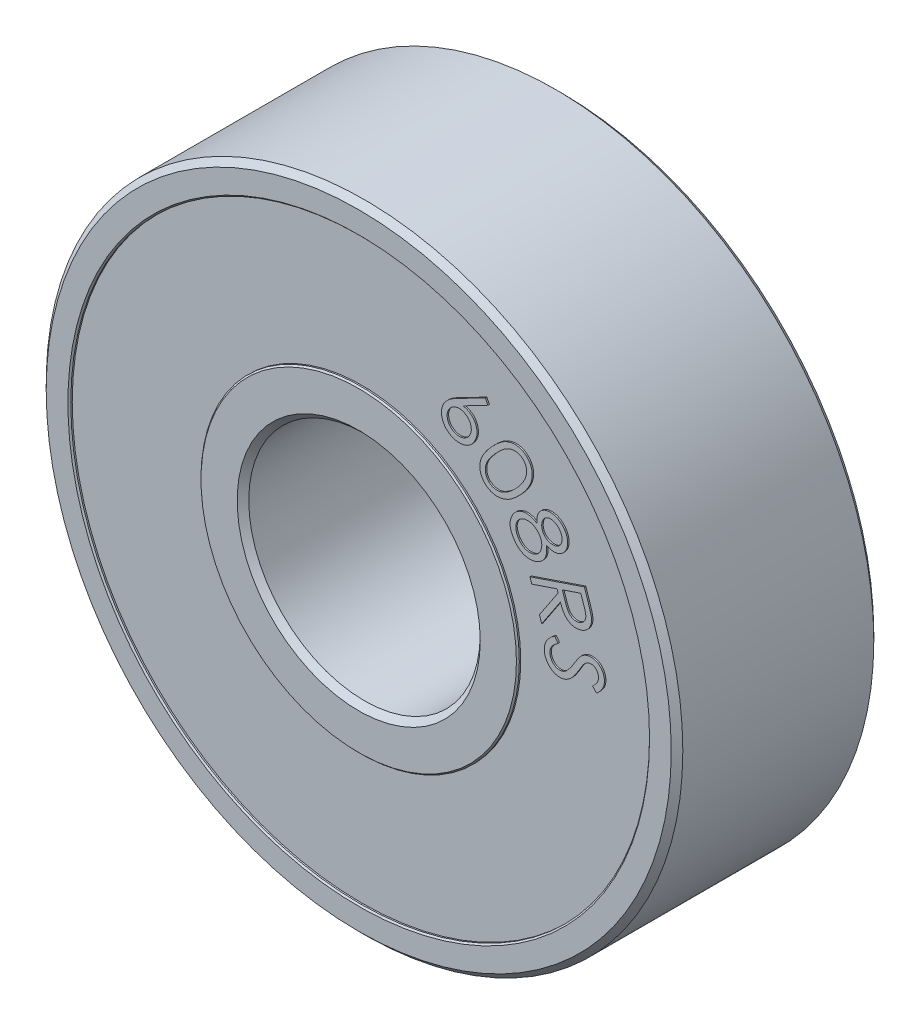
from build123d import *

# Parameters (mm, degrees)
SKETCH1_R           = 11
SKETCH1_R_2         = 4
BOSS_EXTRUDE1_DEPTH = 7
SKETCH2_R           = 10
SKETCH2_R_2         = 5.5
CUT_EXTRUDE1_DEPTH  = 0.1
CUT_EXTRUDE2_START  = -6.9
SKETCH2_2_R         = 10
SKETCH2_2_R_2       = 5.5
CUT_EXTRUDE2_DEPTH  = 0.1
CHAMFER1_SIZE       = 0.2
CHAMFER2_SIZE       = 0.05
BOSS_EXTRUDE2_DEPTH = 0.05
BOSS_EXTRUDE3_DEPTH = 0.05


with BuildPart() as part:
    # Sketch1 → Boss-Extrude1 (new body)
    with BuildSketch(Plane.XY):
        Circle(SKETCH1_R)
        Circle(SKETCH1_R_2, mode=Mode.SUBTRACT)
    extrude(amount=BOSS_EXTRUDE1_DEPTH)

    # Sketch2 → Cut-Extrude1 (cut)
    with BuildSketch(Plane.XY.offset(7)):
        Circle(SKETCH2_R)
        Circle(SKETCH2_R_2, mode=Mode.SUBTRACT)
    extrude(amount=-CUT_EXTRUDE1_DEPTH, mode=Mode.SUBTRACT)

    # Sketch2_2 → Cut-Extrude2 (cut)
    with BuildSketch(Plane.XY.offset(7).offset(CUT_EXTRUDE2_START)):
        Circle(SKETCH2_2_R)
        Circle(SKETCH2_2_R_2, mode=Mode.SUBTRACT)
    extrude(amount=-CUT_EXTRUDE2_DEPTH, mode=Mode.SUBTRACT)

    # Chamfer1
    chamfer1_edges = [part.edges().sort_by_distance(p)[0] for p in [
        (-11, 0, 0),
        (-11, 0, 7),
        (-4, 0, 0),
        (-4, 0, 7),
    ]]
    chamfer(chamfer1_edges, length=CHAMFER1_SIZE)

    # Chamfer2
    chamfer2_edges = [part.edges().sort_by_distance(p)[0] for p in [
        (-10, 0, 7),
        (-5.5, 0, 7),
        (-10, 0, 0),
        (-5.5, 0, 0),
    ]]
    chamfer(chamfer2_edges, length=CHAMFER2_SIZE)

    # Sketch3 → Boss-Extrude2 (add)
    # profile 1 of 5: a face of its own
    with BuildSketch(Plane(origin=(0, 0, 0.1), x_dir=(-1, 0, 0), z_dir=(0, 0, -1))):
        with BuildLine():
            Line((6.723953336, 1.374086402), (6.841741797, 1.216634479))
            add(Edge.make_bspline(
                [(6.841741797, 1.216634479), (6.817573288, 1.199359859), (6.771292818, 1.166280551), (6.7089583, 1.113159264), (6.65797847, 1.058354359), (6.616042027, 1.003718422), (6.585197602, 0.947642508), (6.564677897, 0.890789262), (6.554264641, 0.832905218), (6.556279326, 0.794387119), (6.557286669, 0.775128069)],
                knots=[0, 0, 0, 0, 1.292055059, 2.474166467, 3.555169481, 4.54276915, 5.463097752, 6.326728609, 7.163364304, 8, 8, 8, 8], degree=3))
            add(Edge.make_bspline(
                [(6.557286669, 0.775128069), (6.559589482, 0.75889953), (6.564156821, 0.726712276), (6.577499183, 0.679747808), (6.597073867, 0.635157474), (6.621192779, 0.592867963), (6.650084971, 0.554531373), (6.683420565, 0.521824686), (6.71962411, 0.494193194), (6.759139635, 0.472574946), (6.800541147, 0.456589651), (6.843001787, 0.446611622), (6.8860034, 0.441689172), (6.914655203, 0.443624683), (6.929081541, 0.444599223)],
                knots=[0, 0, 0, 0, 1.065647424, 2.113576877, 3.164384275, 4.227051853, 5.274981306, 6.276492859, 7.256630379, 8.228879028, 9.197081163, 10.13494145, 11.060932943, 12, 12, 12, 12], degree=3))
            add(Edge.make_bspline(
                [(6.929081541, 0.444599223), (6.945519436, 0.447087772), (6.978756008, 0.45211949), (7.026704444, 0.470689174), (7.073741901, 0.496394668), (7.101970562, 0.519552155), (7.116581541, 0.531538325)],
                knots=[0, 0, 0, 0, 0.947990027, 1.916786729, 2.921741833, 4, 4, 4, 4], degree=3))
            add(Edge.make_bspline(
                [(7.116581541, 0.531538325), (7.127135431, 0.541011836), (7.149222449, 0.560837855), (7.181222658, 0.595056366), (7.214764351, 0.633812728), (7.249572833, 0.677474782), (7.285307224, 0.726179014), (7.3219168, 0.780016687), (7.360652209, 0.838318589), (7.38569458, 0.879600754), (7.398632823, 0.900929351)],
                knots=[0, 0, 0, 0, 0.729441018, 1.526562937, 2.408317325, 3.366672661, 4.398852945, 5.515801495, 6.716528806, 8, 8, 8, 8], degree=3))
            add(Edge.make_bspline(
                [(7.398632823, 0.900929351), (7.411481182, 0.922096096), (7.436017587, 0.962518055), (7.472820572, 1.019379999), (7.50609449, 1.07074534), (7.537338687, 1.115557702), (7.565826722, 1.154147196), (7.591394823, 1.186795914), (7.614407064, 1.213420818), (7.629713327, 1.228338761), (7.636613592, 1.235063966)],
                knots=[0, 0, 0, 0, 1.445236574, 2.759956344, 3.953419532, 5.017350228, 5.948124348, 6.752849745, 7.43776821, 8, 8, 8, 8], degree=3))
            add(Edge.make_bspline(
                [(7.636613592, 1.235063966), (7.647453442, 1.244543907), (7.668850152, 1.263256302), (7.702463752, 1.288692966), (7.737555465, 1.310371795), (7.773613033, 1.328839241), (7.810780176, 1.344090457), (7.848714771, 1.356654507), (7.887907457, 1.365581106), (7.91448874, 1.368839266), (7.927879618, 1.370480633)],
                knots=[0, 0, 0, 0, 1.056756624, 2.085925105, 3.08957304, 4.080262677, 5.055903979, 6.035378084, 7.010280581, 8, 8, 8, 8], degree=3))
            add(Edge.make_bspline(
                [(7.927879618, 1.370480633), (7.948981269, 1.371870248), (7.990587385, 1.37461015), (8.052279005, 1.368496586), (8.111981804, 1.355515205), (8.168798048, 1.333504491), (8.222511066, 1.304967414), (8.271642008, 1.26880591), (8.315398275, 1.225611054), (8.35382237, 1.176261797), (8.385992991, 1.122092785), (8.41166226, 1.064244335), (8.429536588, 1.002885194), (8.435353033, 0.960458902), (8.438296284, 0.938990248)],
                knots=[0, 0, 0, 0, 1.01991207, 2.010960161, 2.982781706, 3.962746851, 4.943984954, 5.912890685, 6.898148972, 7.904611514, 8.925685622, 9.933656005, 10.954383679, 12, 12, 12, 12], degree=3))
            add(Edge.make_bspline(
                [(8.438296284, 0.938990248), (8.439905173, 0.916018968), (8.443100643, 0.870394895), (8.435954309, 0.802226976), (8.421251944, 0.735375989), (8.401131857, 0.681031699), (8.37977872, 0.638088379), (8.360564, 0.604548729), (8.337040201, 0.570775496), (8.310670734, 0.53558058), (8.279863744, 0.500254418), (8.246489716, 0.463106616), (8.208609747, 0.426121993), (8.181946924, 0.401530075), (8.168264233, 0.38891012)],
                knots=[0, 0, 0, 0, 1.294867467, 2.571782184, 3.843746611, 5.143215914, 5.822746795, 6.543964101, 7.318006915, 8.13942962, 9.019769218, 9.956863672, 10.951513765, 12, 12, 12, 12], degree=3))
            Line((8.168264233, 0.38891012), (8.029642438, 0.537547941))
            add(Edge.make_bspline(
                [(8.029642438, 0.537547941), (8.040491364, 0.547797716), (8.061430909, 0.567580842), (8.091198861, 0.596726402), (8.1177117, 0.624750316), (8.140998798, 0.651703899), (8.161430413, 0.677149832), (8.178807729, 0.701361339), (8.193307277, 0.724006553), (8.208313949, 0.752376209), (8.222111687, 0.78797107), (8.232490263, 0.831773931), (8.237254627, 0.876823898), (8.235338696, 0.906937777), (8.234370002, 0.922163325)],
                knots=[0, 0, 0, 0, 1.182699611, 2.282732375, 3.300866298, 4.238668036, 5.104698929, 5.88587987, 6.599324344, 7.233663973, 8.426546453, 9.612413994, 10.792838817, 12, 12, 12, 12], degree=3))
            add(Edge.make_bspline(
                [(8.234370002, 0.922163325), (8.231544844, 0.941132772), (8.226095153, 0.97772457), (8.207511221, 1.029103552), (8.179226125, 1.07342249), (8.143481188, 1.110786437), (8.101919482, 1.139998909), (8.056290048, 1.160326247), (8.006902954, 1.169811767), (7.973443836, 1.168186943), (7.956325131, 1.167355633)],
                knots=[0, 0, 0, 0, 1.109513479, 2.140235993, 3.138523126, 4.134648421, 5.117916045, 6.063936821, 7.00945106, 8, 8, 8, 8], degree=3))
            add(Edge.make_bspline(
                [(7.956325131, 1.167355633), (7.945745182, 1.165793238), (7.92452439, 1.162659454), (7.893216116, 1.154810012), (7.863019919, 1.142853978), (7.833191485, 1.128051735), (7.803915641, 1.108026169), (7.773495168, 1.083650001), (7.743435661, 1.052289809), (7.723571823, 1.029230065), (7.713136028, 1.017115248)],
                knots=[0, 0, 0, 0, 0.872627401, 1.750277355, 2.626708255, 3.518723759, 4.461878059, 5.515567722, 6.694762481, 8, 8, 8, 8], degree=3))
            add(Edge.make_bspline(
                [(7.713136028, 1.017115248), (7.709759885, 1.012601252), (7.701657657, 1.00176835), (7.688608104, 0.982001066), (7.672276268, 0.956433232), (7.65262288, 0.924978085), (7.629276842, 0.887948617), (7.60342511, 0.84439932), (7.573757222, 0.795347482), (7.552995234, 0.760582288), (7.54206231, 0.742275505)],
                knots=[0, 0, 0, 0, 0.417704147, 1.002426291, 1.754721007, 2.666443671, 3.751275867, 4.998903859, 6.419671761, 8, 8, 8, 8], degree=3))
            add(Edge.make_bspline(
                [(7.54206231, 0.742275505), (7.528720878, 0.72014766), (7.502869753, 0.677271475), (7.462909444, 0.616494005), (7.424908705, 0.560118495), (7.386533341, 0.509633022), (7.349495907, 0.463846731), (7.313037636, 0.423278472), (7.277439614, 0.387815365), (7.231706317, 0.348414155), (7.174122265, 0.307697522), (7.102778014, 0.269865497), (7.029575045, 0.243643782), (6.979473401, 0.23602383), (6.954722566, 0.232259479)],
                knots=[0, 0, 0, 0, 1.151589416, 2.231385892, 3.241866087, 4.181198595, 5.056967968, 5.86622306, 6.611257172, 7.295010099, 8.555133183, 9.745337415, 10.8861687, 12, 12, 12, 12], degree=3))
            add(Edge.make_bspline(
                [(6.954722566, 0.232259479), (6.937104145, 0.230954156), (6.902273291, 0.228373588), (6.850287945, 0.230996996), (6.799553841, 0.238604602), (6.7498888, 0.251362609), (6.70178582, 0.270191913), (6.654518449, 0.293243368), (6.609132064, 0.322693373), (6.565113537, 0.35621304), (6.524107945, 0.393956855), (6.487534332, 0.434933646), (6.45562657, 0.478557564), (6.428202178, 0.524760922), (6.405676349, 0.573922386), (6.388114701, 0.625763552), (6.37509852, 0.680239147), (6.370249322, 0.717645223), (6.367783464, 0.73666653)],
                knots=[0, 0, 0, 0, 0.985637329, 1.948562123, 2.898699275, 3.846375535, 4.804641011, 5.778360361, 6.777444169, 7.819911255, 8.864722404, 9.88397061, 10.881717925, 11.877903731, 12.878850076, 13.895148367, 14.929665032, 16, 16, 16, 16], degree=3))
            add(Edge.make_bspline(
                [(6.367783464, 0.73666653), (6.366427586, 0.751479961), (6.36374365, 0.780802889), (6.364781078, 0.824712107), (6.366958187, 0.867892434), (6.373888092, 0.910243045), (6.38267062, 0.952061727), (6.395985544, 0.99277455), (6.410879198, 1.033227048), (6.430041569, 1.072638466), (6.452506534, 1.111705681), (6.479103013, 1.150236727), (6.509821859, 1.188344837), (6.544257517, 1.226550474), (6.583270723, 1.264064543), (6.626226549, 1.301327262), (6.673295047, 1.338362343), (6.706747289, 1.361952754), (6.723953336, 1.374086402)],
                knots=[0, 0, 0, 0, 0.924783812, 1.830593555, 2.729938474, 3.612542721, 4.497647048, 5.385983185, 6.274940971, 7.178116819, 8.108855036, 9.07694148, 10.087910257, 11.152769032, 12.275211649, 13.45327497, 14.690100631, 16, 16, 16, 16], degree=3))
        make_face()
    # profile 2 of 5: a face of its own
    with BuildSketch(Plane(origin=(0, 0, 0.1), x_dir=(-1, 0, 0), z_dir=(0, 0, -1))):
        with BuildLine():
            Line((7.746137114, 3.357649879), (7.872739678, 2.983451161))
            add(Edge.make_bspline(
                [(7.872739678, 2.983451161), (7.881059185, 2.958357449), (7.896967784, 2.910373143), (7.919192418, 2.841249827), (7.93827157, 2.778162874), (7.954988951, 2.721116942), (7.968277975, 2.670083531), (7.97810167, 2.624967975), (7.986304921, 2.586220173), (7.989206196, 2.562134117), (7.99052814, 2.551159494)],
                knots=[0, 0, 0, 0, 1.41401025, 2.703876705, 3.883389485, 4.939117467, 5.883308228, 6.703003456, 7.409033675, 8, 8, 8, 8], degree=3))
            add(Edge.make_bspline(
                [(7.99052814, 2.551159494), (7.991680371, 2.536346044), (7.993961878, 2.507014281), (7.99355178, 2.463189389), (7.989536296, 2.420458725), (7.982244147, 2.378807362), (7.971867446, 2.338150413), (7.957859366, 2.298427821), (7.940049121, 2.259949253), (7.919392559, 2.222682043), (7.895267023, 2.187520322), (7.868522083, 2.15435442), (7.838146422, 2.124526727), (7.805654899, 2.096319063), (7.769505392, 2.071821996), (7.730676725, 2.049581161), (7.689074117, 2.029824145), (7.65969703, 2.019263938), (7.644774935, 2.013899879)],
                knots=[0, 0, 0, 0, 1.027353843, 2.034239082, 3.026914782, 3.992754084, 4.956116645, 5.926055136, 6.901519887, 7.885736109, 8.869562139, 9.847691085, 10.827432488, 11.810304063, 12.819812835, 13.841795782, 14.903739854, 16, 16, 16, 16], degree=3))
            add(Edge.make_bspline(
                [(7.644774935, 2.013899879), (7.619571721, 2.006225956), (7.570483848, 1.991279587), (7.495245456, 1.981482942), (7.421726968, 1.981550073), (7.350113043, 1.99285135), (7.28164526, 2.01459628), (7.217050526, 2.046407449), (7.157909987, 2.089546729), (7.111856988, 2.132170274), (7.078246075, 2.172604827), (7.052872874, 2.206693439), (7.028502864, 2.24470871), (7.00542963, 2.286885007), (6.981948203, 2.332291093), (6.960215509, 2.382102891), (6.938952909, 2.435460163), (6.925647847, 2.472458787), (6.918813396, 2.491463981)],
                knots=[0, 0, 0, 0, 1.278263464, 2.489652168, 3.670679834, 4.839936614, 5.997393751, 7.149490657, 8.321732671, 9.542815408, 10.187555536, 10.874109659, 11.606713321, 12.379429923, 13.209421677, 14.089665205, 15.018712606, 16, 16, 16, 16], degree=3))
            Line((6.918813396, 2.491463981), (6.274181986, 1.519909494))
            Line((6.274181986, 1.519909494), (6.195656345, 1.75268193))
            Line((6.195656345, 1.75268193), (6.840688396, 2.722633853))
            Line((6.840688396, 2.722633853), (6.804630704, 2.829605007))
            Line((6.804630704, 2.829605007), (5.931233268, 2.53393193))
            Line((5.931233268, 2.53393193), (5.867531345, 2.721832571))
            Line((5.867531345, 2.721832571), (7.746137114, 3.357649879))
        make_face()
        with BuildLine():
            Line((7.625944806, 3.107649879), (6.987323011, 2.891303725))
            Line((6.987323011, 2.891303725), (7.093893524, 2.567585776))
            add(Edge.make_bspline(
                [(7.093893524, 2.567585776), (7.099141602, 2.552460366), (7.109268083, 2.523274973), (7.12546665, 2.481526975), (7.141165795, 2.442969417), (7.157905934, 2.408224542), (7.173577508, 2.37635315), (7.19005439, 2.34833638), (7.206517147, 2.323717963), (7.228098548, 2.295648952), (7.257158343, 2.265709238), (7.296463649, 2.236869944), (7.338965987, 2.214103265), (7.38510297, 2.199047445), (7.432884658, 2.190547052), (7.481570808, 2.189590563), (7.530612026, 2.194710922), (7.562229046, 2.204464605), (7.578268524, 2.209412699)],
                knots=[0, 0, 0, 0, 1.118554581, 2.158318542, 3.128777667, 4.026236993, 4.852521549, 5.609511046, 6.2953485, 6.920617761, 8.081985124, 9.196171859, 10.314843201, 11.436157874, 12.572935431, 13.69304583, 14.829670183, 16, 16, 16, 16], degree=3))
            add(Edge.make_bspline(
                [(7.578268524, 2.209412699), (7.59342902, 2.215251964), (7.62342383, 2.226804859), (7.664579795, 2.251684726), (7.701464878, 2.282014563), (7.733367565, 2.317620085), (7.759719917, 2.357194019), (7.780045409, 2.399320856), (7.793065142, 2.44385535), (7.798012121, 2.482767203), (7.798617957, 2.516069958), (7.796430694, 2.544330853), (7.791830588, 2.575579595), (7.785411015, 2.609926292), (7.776957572, 2.647370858), (7.766058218, 2.687842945), (7.752740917, 2.731460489), (7.742856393, 2.761514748), (7.737723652, 2.777121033)],
                knots=[0, 0, 0, 0, 1.157480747, 2.290057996, 3.413820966, 4.554229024, 5.688088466, 6.796349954, 7.878911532, 8.984095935, 9.584534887, 10.253304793, 11.003966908, 11.837573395, 12.74613744, 13.742422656, 14.827707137, 16, 16, 16, 16], degree=3))
            Line((7.737723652, 2.777121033), (7.625944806, 3.107649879))
        make_face(mode=Mode.SUBTRACT)
    # profile 3 of 5: a face of its own
    with BuildSketch(Plane(origin=(0, 0, 0.1), x_dir=(-1, 0, 0), z_dir=(0, 0, -1))):
        with BuildLine():
            add(Edge.make_bspline(
                [(6.436645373, 3.958851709), (6.438849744, 3.940573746), (6.443153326, 3.904889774), (6.446080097, 3.852458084), (6.447345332, 3.802571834), (6.444615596, 3.755237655), (6.440242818, 3.710182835), (6.431945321, 3.667690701), (6.421801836, 3.627540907), (6.408467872, 3.589869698), (6.392118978, 3.554645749), (6.374421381, 3.520656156), (6.353059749, 3.489126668), (6.330588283, 3.458332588), (6.304473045, 3.429986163), (6.276658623, 3.402650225), (6.246016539, 3.377299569), (6.224148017, 3.36201487), (6.213087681, 3.354284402)],
                knots=[0, 0, 0, 0, 1.290890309, 2.520198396, 3.681805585, 4.788490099, 5.843551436, 6.853927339, 7.821726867, 8.74603337, 9.651448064, 10.544029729, 11.429902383, 12.319727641, 13.215057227, 14.129151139, 15.053789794, 16, 16, 16, 16], degree=3))
            add(Edge.make_bspline(
                [(6.213087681, 3.354284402), (6.197080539, 3.344144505), (6.165376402, 3.324061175), (6.115609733, 3.298721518), (6.064443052, 3.278646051), (6.012154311, 3.263322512), (5.958510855, 3.252871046), (5.903673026, 3.247212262), (5.847609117, 3.246868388), (5.810160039, 3.250090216), (5.791212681, 3.251720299)],
                knots=[0, 0, 0, 0, 1.02459754, 2.029343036, 3.015319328, 3.993724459, 4.972689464, 5.967517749, 6.971665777, 8, 8, 8, 8], degree=3))
            add(Edge.make_bspline(
                [(5.791212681, 3.251720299), (5.76812279, 3.255152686), (5.722105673, 3.26199328), (5.655371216, 3.282467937), (5.591465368, 3.310695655), (5.530691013, 3.347287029), (5.472409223, 3.391028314), (5.417139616, 3.44291569), (5.364964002, 3.502778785), (5.333693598, 3.547097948), (5.317654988, 3.569829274)],
                knots=[0, 0, 0, 0, 0.94927729, 1.891867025, 2.831441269, 3.787189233, 4.773456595, 5.792841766, 6.867947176, 8, 8, 8, 8], degree=3))
            add(Edge.make_bspline(
                [(5.317654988, 3.569829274), (5.303063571, 3.592276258), (5.274661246, 3.635969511), (5.240442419, 3.70396576), (5.213126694, 3.770723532), (5.193673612, 3.836759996), (5.18189304, 3.902041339), (5.177652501, 3.9664582), (5.181746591, 4.030123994), (5.193666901, 4.092147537), (5.210811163, 4.152011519), (5.232533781, 4.208453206), (5.257704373, 4.261497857), (5.287473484, 4.310315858), (5.320899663, 4.355598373), (5.358263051, 4.396995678), (5.399718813, 4.434649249), (5.43013903, 4.456340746), (5.445459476, 4.467265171)],
                knots=[0, 0, 0, 0, 1.265189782, 2.462703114, 3.593198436, 4.67234407, 5.711673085, 6.724080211, 7.71757927, 8.719632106, 9.70506986, 10.658584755, 11.576575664, 12.477685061, 13.358041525, 14.234425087, 15.110808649, 16, 16, 16, 16], degree=3))
            add(Edge.make_bspline(
                [(5.445459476, 4.467265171), (5.456987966, 4.474624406), (5.480000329, 4.489314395), (5.515649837, 4.508441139), (5.552366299, 4.524126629), (5.589327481, 4.537519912), (5.627481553, 4.547343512), (5.665928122, 4.555312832), (5.705401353, 4.558925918), (5.745399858, 4.560814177), (5.786673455, 4.559096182), (5.829078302, 4.554049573), (5.872697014, 4.544281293), (5.91778122, 4.532182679), (5.964098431, 4.515785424), (6.011833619, 4.496274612), (6.060588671, 4.472457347), (6.093098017, 4.454707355), (6.109722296, 4.445630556)],
                knots=[0, 0, 0, 0, 0.931334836, 1.859065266, 2.751202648, 3.648748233, 4.533436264, 5.43245535, 6.319384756, 7.229651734, 8.158095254, 9.129430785, 10.133761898, 11.19951572, 12.306952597, 13.477470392, 14.710056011, 16, 16, 16, 16], degree=3))
            add(Edge.make_bspline(
                [(6.109722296, 4.445630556), (6.107482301, 4.47205299), (6.10313889, 4.52328682), (6.107287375, 4.598282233), (6.11985051, 4.668288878), (6.14164351, 4.732865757), (6.171434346, 4.791786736), (6.208476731, 4.844446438), (6.252045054, 4.891203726), (6.28610488, 4.91622277), (6.303231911, 4.928803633)],
                knots=[0, 0, 0, 0, 1.159116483, 2.247558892, 3.275615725, 4.262372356, 5.218835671, 6.154236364, 7.07185513, 8, 8, 8, 8], degree=3))
            add(Edge.make_bspline(
                [(6.303231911, 4.928803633), (6.321754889, 4.940084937), (6.359014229, 4.962777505), (6.421256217, 4.986222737), (6.488036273, 5.000993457), (6.558445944, 5.007117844), (6.630670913, 5.005090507), (6.702669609, 4.992413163), (6.77329377, 4.969774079), (6.841463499, 4.937151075), (6.906181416, 4.896456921), (6.965941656, 4.848096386), (7.019799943, 4.792057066), (7.050247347, 4.749841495), (7.065651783, 4.72848312)],
                knots=[0, 0, 0, 0, 0.892779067, 1.795842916, 2.727080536, 3.70581188, 4.703144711, 5.698163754, 6.710047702, 7.752069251, 8.806330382, 9.855631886, 10.91508709, 12, 12, 12, 12], degree=3))
            add(Edge.make_bspline(
                [(7.065651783, 4.72848312), (7.079336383, 4.706774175), (7.106401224, 4.663839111), (7.136261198, 4.594226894), (7.157475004, 4.522286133), (7.168858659, 4.44845505), (7.171401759, 4.374581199), (7.164611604, 4.302250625), (7.148558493, 4.232231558), (7.122885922, 4.165630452), (7.089294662, 4.103906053), (7.0495902, 4.047721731), (7.002341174, 3.999113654), (6.966283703, 3.972535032), (6.948263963, 3.95925235)],
                knots=[0, 0, 0, 0, 1.068771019, 2.113771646, 3.146516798, 4.18939315, 5.220229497, 6.221594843, 7.210477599, 8.206485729, 9.188317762, 10.134173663, 11.067552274, 12, 12, 12, 12], degree=3))
            add(Edge.make_bspline(
                [(6.948263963, 3.95925235), (6.92948131, 3.947579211), (6.892704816, 3.924723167), (6.832726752, 3.900840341), (6.770949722, 3.886814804), (6.707208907, 3.88185386), (6.641795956, 3.887028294), (6.57452711, 3.90142974), (6.505301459, 3.925243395), (6.460060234, 3.947389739), (6.436645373, 3.958851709)],
                knots=[0, 0, 0, 0, 0.981875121, 1.922514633, 2.854567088, 3.789622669, 4.754286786, 5.76174218, 6.841576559, 8, 8, 8, 8], degree=3))
        make_face()
        with BuildLine():
            add(Edge.make_bspline(
                [(6.899786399, 4.627521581), (6.89206632, 4.638457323), (6.87685916, 4.659998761), (6.851731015, 4.689696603), (6.824543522, 4.715861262), (6.79632334, 4.739189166), (6.766173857, 4.759065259), (6.734647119, 4.775820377), (6.701543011, 4.789622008), (6.667263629, 4.799834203), (6.632827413, 4.807110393), (6.598864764, 4.810677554), (6.565845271, 4.811257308), (6.533573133, 4.808043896), (6.502305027, 4.801150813), (6.471895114, 4.791090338), (6.442508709, 4.777396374), (6.423983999, 4.765933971), (6.414610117, 4.760133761)],
                knots=[0, 0, 0, 0, 1.147797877, 2.260954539, 3.330167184, 4.38025149, 5.396817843, 6.421610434, 7.438370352, 8.467442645, 9.485040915, 10.452679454, 11.391973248, 12.312859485, 13.227240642, 14.132754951, 15.055135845, 16, 16, 16, 16], degree=3))
            add(Edge.make_bspline(
                [(6.414610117, 4.760133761), (6.405774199, 4.753786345), (6.388108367, 4.741095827), (6.364373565, 4.718498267), (6.343734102, 4.693036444), (6.324762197, 4.66560438), (6.309508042, 4.635122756), (6.296405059, 4.602338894), (6.286620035, 4.566820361), (6.27902636, 4.529487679), (6.274755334, 4.491152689), (6.273205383, 4.453199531), (6.276275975, 4.416049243), (6.282273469, 4.379861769), (6.29134367, 4.344469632), (6.304515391, 4.310097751), (6.320673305, 4.276359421), (6.334378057, 4.255189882), (6.341292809, 4.244508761)],
                knots=[0, 0, 0, 0, 0.908844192, 1.81707094, 2.729132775, 3.645761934, 4.599514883, 5.571907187, 6.593318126, 7.675011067, 8.753876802, 9.815092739, 10.84525358, 11.863975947, 12.879511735, 13.893573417, 14.937199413, 16, 16, 16, 16], degree=3))
            add(Edge.make_bspline(
                [(6.341292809, 4.244508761), (6.350814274, 4.231255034), (6.369827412, 4.204789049), (6.404691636, 4.170598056), (6.443344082, 4.140394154), (6.485652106, 4.115036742), (6.53091205, 4.095367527), (6.577788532, 4.082025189), (6.625777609, 4.074990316), (6.673984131, 4.075405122), (6.721007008, 4.080627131), (6.765184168, 4.092077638), (6.806448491, 4.107815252), (6.831074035, 4.122859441), (6.843296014, 4.130326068)],
                knots=[0, 0, 0, 0, 1.029778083, 2.056334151, 3.072742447, 4.125103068, 5.164692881, 6.18264204, 7.197261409, 8.21856438, 9.221531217, 10.179595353, 11.096509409, 12, 12, 12, 12], degree=3))
            add(Edge.make_bspline(
                [(6.843296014, 4.130326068), (6.851446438, 4.13616324), (6.867594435, 4.147728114), (6.88939698, 4.168131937), (6.90904658, 4.190508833), (6.92640353, 4.215277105), (6.941639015, 4.242075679), (6.954455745, 4.271261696), (6.965288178, 4.302452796), (6.973600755, 4.335686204), (6.979511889, 4.370209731), (6.980683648, 4.405777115), (6.977172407, 4.441591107), (6.970465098, 4.478043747), (6.9591051, 4.514969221), (6.943248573, 4.552252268), (6.923519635, 4.590151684), (6.907856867, 4.614813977), (6.899786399, 4.627521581)],
                knots=[0, 0, 0, 0, 0.860567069, 1.704995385, 2.558804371, 3.415153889, 4.298967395, 5.203031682, 6.150124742, 7.132495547, 8.143595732, 9.153914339, 10.17923786, 11.230179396, 12.333615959, 13.490750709, 14.707072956, 16, 16, 16, 16], degree=3))
        make_face(mode=Mode.SUBTRACT)
        with BuildLine():
            add(Edge.make_bspline(
                [(6.192654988, 4.141544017), (6.183073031, 4.155401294), (6.164227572, 4.182655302), (6.131187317, 4.218933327), (6.097015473, 4.252070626), (6.059989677, 4.280785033), (6.020837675, 4.305788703), (5.978908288, 4.326108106), (5.934953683, 4.342757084), (5.889255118, 4.354794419), (5.843074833, 4.363522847), (5.797427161, 4.366805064), (5.753115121, 4.366894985), (5.710232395, 4.361231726), (5.668413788, 4.352462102), (5.628232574, 4.337906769), (5.58882321, 4.320171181), (5.564407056, 4.304523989), (5.552029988, 4.296592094)],
                knots=[0, 0, 0, 0, 1.103096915, 2.169532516, 3.209705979, 4.22005898, 5.235178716, 6.249127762, 7.268541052, 8.31114268, 9.343069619, 10.344088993, 11.307028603, 12.241865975, 13.174241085, 14.101672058, 15.037697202, 16, 16, 16, 16], degree=3))
            add(Edge.make_bspline(
                [(5.552029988, 4.296592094), (5.53739373, 4.285920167), (5.508158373, 4.264603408), (5.470459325, 4.225147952), (5.438160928, 4.180583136), (5.411429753, 4.131524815), (5.391128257, 4.078821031), (5.379712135, 4.02334043), (5.375573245, 3.966204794), (5.379709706, 3.907692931), (5.391978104, 3.848519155), (5.411845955, 3.789219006), (5.439605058, 3.729865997), (5.463581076, 3.692173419), (5.475908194, 3.672794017)],
                knots=[0, 0, 0, 0, 0.926109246, 1.849867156, 2.780058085, 3.737943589, 4.703270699, 5.660960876, 6.627667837, 7.628486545, 8.654526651, 9.714225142, 10.824783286, 12, 12, 12, 12], degree=3))
            add(Edge.make_bspline(
                [(5.475908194, 3.672794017), (5.486060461, 3.658170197), (5.505883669, 3.629615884), (5.539352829, 3.591150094), (5.574498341, 3.557119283), (5.611193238, 3.52754691), (5.649610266, 3.502113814), (5.690285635, 3.482258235), (5.73254201, 3.466467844), (5.776087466, 3.455386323), (5.819965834, 3.44854851), (5.863310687, 3.446190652), (5.905570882, 3.447721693), (5.946649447, 3.453327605), (5.986515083, 3.463003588), (6.025261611, 3.476638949), (6.062787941, 3.494832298), (6.086485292, 3.509769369), (6.098504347, 3.517345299)],
                knots=[0, 0, 0, 0, 1.19035752, 2.32427924, 3.40484362, 4.459799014, 5.473418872, 6.48040078, 7.481219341, 8.486773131, 9.481309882, 10.447796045, 11.386669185, 12.306601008, 13.216804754, 14.126789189, 15.049926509, 16, 16, 16, 16], degree=3))
            add(Edge.make_bspline(
                [(6.098504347, 3.517345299), (6.109623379, 3.525413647), (6.131612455, 3.541369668), (6.161538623, 3.568937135), (6.18821179, 3.599437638), (6.210866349, 3.633334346), (6.230793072, 3.669716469), (6.247216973, 3.709047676), (6.259874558, 3.751393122), (6.269542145, 3.795841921), (6.274911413, 3.841443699), (6.276921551, 3.886781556), (6.273360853, 3.931306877), (6.266335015, 3.975088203), (6.254596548, 4.018173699), (6.238424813, 4.06039773), (6.21802423, 4.101939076), (6.201197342, 4.128208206), (6.192654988, 4.141544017)],
                knots=[0, 0, 0, 0, 0.942671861, 1.864234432, 2.78725575, 3.718123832, 4.657802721, 5.631928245, 6.638488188, 7.688830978, 8.751153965, 9.788000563, 10.799352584, 11.812407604, 12.828984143, 13.859322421, 14.913261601, 16, 16, 16, 16], degree=3))
        make_face(mode=Mode.SUBTRACT)
    # profile 4 of 5: a face of its own
    with BuildSketch(Plane(origin=(0, 0, 0.1), x_dir=(-1, 0, 0), z_dir=(0, 0, -1))):
        with BuildLine():
            add(Edge.make_bspline(
                [(4.543033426, 5.949335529), (4.564943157, 5.972693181), (4.607527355, 6.018091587), (4.67157506, 6.0821776), (4.733665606, 6.140505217), (4.794137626, 6.192741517), (4.85293655, 6.238729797), (4.909649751, 6.279135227), (4.964441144, 6.313866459), (5.018164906, 6.342452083), (5.070566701, 6.366205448), (5.122024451, 6.38603643), (5.172895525, 6.401712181), (5.223134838, 6.413290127), (5.272621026, 6.421532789), (5.321665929, 6.425568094), (5.370160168, 6.42549656), (5.417968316, 6.42189385), (5.464631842, 6.414853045), (5.509827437, 6.403785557), (5.553710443, 6.389848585), (5.596047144, 6.372253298), (5.636808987, 6.351171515), (5.676066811, 6.327121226), (5.714074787, 6.299926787), (5.737519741, 6.279144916), (5.749363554, 6.268646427)],
                knots=[0, 0, 0, 0, 1.642537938, 3.192470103, 4.646338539, 6.011168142, 7.289605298, 8.473669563, 9.581665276, 10.614373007, 11.59226402, 12.531086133, 13.441104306, 14.320069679, 15.173659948, 16.012137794, 16.84096325, 17.65841702, 18.469272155, 19.258427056, 20.042601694, 20.82874835, 21.606886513, 22.39398752, 23.188682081, 24, 24, 24, 24], degree=3))
            add(Edge.make_bspline(
                [(5.749363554, 6.268646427), (5.760911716, 6.257617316), (5.783832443, 6.2357268), (5.814606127, 6.199685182), (5.842763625, 6.162273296), (5.86720813, 6.122744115), (5.888632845, 6.081687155), (5.906688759, 6.038659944), (5.921436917, 5.993756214), (5.933125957, 5.947322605), (5.941123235, 5.899359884), (5.945576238, 5.850210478), (5.945937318, 5.799696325), (5.942178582, 5.748167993), (5.934948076, 5.695283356), (5.923723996, 5.64133292), (5.908257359, 5.586132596), (5.889035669, 5.529625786), (5.865374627, 5.471491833), (5.83582998, 5.412255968), (5.80126516, 5.351314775), (5.761491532, 5.288687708), (5.716170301, 5.224741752), (5.665349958, 5.159251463), (5.609380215, 5.092013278), (5.569231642, 5.047489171), (5.5486424, 5.024656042)],
                knots=[0, 0, 0, 0, 0.812736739, 1.613115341, 2.410193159, 3.195255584, 3.977011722, 4.766451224, 5.568648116, 6.381840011, 7.202505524, 8.042362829, 8.892510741, 9.771967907, 10.671265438, 11.608935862, 12.575845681, 13.588824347, 14.647177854, 15.769502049, 16.957239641, 18.213799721, 19.545973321, 20.947120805, 22.434403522, 24, 24, 24, 24], degree=3))
            add(Edge.make_bspline(
                [(5.5486424, 5.024656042), (5.527680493, 5.002353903), (5.486797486, 4.958856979), (5.424765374, 4.897538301), (5.363751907, 4.841756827), (5.304193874, 4.791136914), (5.245683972, 4.746127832), (5.188196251, 4.706632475), (5.131917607, 4.672564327), (5.076622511, 4.643827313), (5.022302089, 4.620150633), (4.968866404, 4.60056073), (4.916443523, 4.584153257), (4.864386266, 4.572744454), (4.813189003, 4.564345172), (4.762509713, 4.561020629), (4.712689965, 4.560768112), (4.663807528, 4.564917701), (4.616099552, 4.572413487), (4.569931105, 4.58374163), (4.525340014, 4.598193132), (4.482211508, 4.615751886), (4.440882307, 4.637302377), (4.400706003, 4.661523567), (4.362510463, 4.689746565), (4.338690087, 4.710774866), (4.326687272, 4.721370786)],
                knots=[0, 0, 0, 0, 1.559433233, 3.041436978, 4.443008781, 5.770818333, 7.022943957, 8.202580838, 9.32288808, 10.372875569, 11.375398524, 12.339881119, 13.271916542, 14.171621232, 15.053181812, 15.912749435, 16.756523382, 17.589472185, 18.409479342, 19.214872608, 20.008917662, 20.796169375, 21.584390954, 22.381462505, 23.184437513, 24, 24, 24, 24], degree=3))
            add(Edge.make_bspline(
                [(4.326687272, 4.721370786), (4.315260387, 4.732257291), (4.292582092, 4.753863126), (4.262524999, 4.789474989), (4.234216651, 4.825811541), (4.210591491, 4.864827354), (4.189388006, 4.905106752), (4.171852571, 4.947252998), (4.157409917, 4.991049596), (4.146081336, 5.036416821), (4.1385724, 5.083328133), (4.134475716, 5.131406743), (4.134526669, 5.180589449), (4.138668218, 5.230653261), (4.146378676, 5.281762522), (4.157589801, 5.333992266), (4.172890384, 5.387243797), (4.192316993, 5.44187928), (4.216511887, 5.49808747), (4.245828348, 5.556425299), (4.281385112, 5.616628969), (4.322888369, 5.67887757), (4.369244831, 5.744006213), (4.421956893, 5.810719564), (4.480129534, 5.879757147), (4.521656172, 5.925690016), (4.543033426, 5.949335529)],
                knots=[0, 0, 0, 0, 0.809667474, 1.606901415, 2.389915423, 3.171938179, 3.944739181, 4.725317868, 5.512374, 6.310580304, 7.123290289, 7.948912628, 8.785395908, 9.645186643, 10.525642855, 11.437417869, 12.385812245, 13.368196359, 14.41253519, 15.525600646, 16.717987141, 17.999697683, 19.365829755, 20.821103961, 22.363554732, 24, 24, 24, 24], degree=3))
        make_face()
        with BuildLine():
            add(Edge.make_bspline(
                [(4.679251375, 5.818325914), (4.660851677, 5.798119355), (4.625169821, 5.75893352), (4.575066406, 5.700527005), (4.530060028, 5.644381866), (4.490109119, 5.590608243), (4.454150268, 5.539934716), (4.423546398, 5.49144367), (4.398220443, 5.445165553), (4.377241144, 5.40129025), (4.35988931, 5.359114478), (4.347091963, 5.31763911), (4.335718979, 5.277328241), (4.328855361, 5.237439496), (4.323935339, 5.198395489), (4.323658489, 5.159929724), (4.324705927, 5.122099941), (4.332062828, 5.073644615), (4.346039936, 5.016229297), (4.372941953, 4.953168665), (4.40806014, 4.896592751), (4.438775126, 4.865487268), (4.454091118, 4.849976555)],
                knots=[0, 0, 0, 0, 1.475488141, 2.861359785, 4.154121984, 5.359730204, 6.477947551, 7.508249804, 8.453740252, 9.324547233, 10.133287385, 10.913161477, 11.667000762, 12.392548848, 13.096455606, 13.788819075, 14.467224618, 15.137185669, 16.431314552, 17.646052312, 18.826206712, 20, 20, 20, 20], degree=3))
            add(Edge.make_bspline(
                [(4.454091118, 4.849976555), (4.470998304, 4.835844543), (4.504676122, 4.807694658), (4.563731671, 4.776736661), (4.628146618, 4.755513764), (4.685580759, 4.74573126), (4.73346006, 4.743796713), (4.770607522, 4.744784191), (4.808256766, 4.749765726), (4.846476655, 4.7579731), (4.885356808, 4.768707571), (4.924789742, 4.782747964), (4.964461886, 4.800624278), (4.990744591, 4.814196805), (5.004171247, 4.821130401)],
                knots=[0, 0, 0, 0, 1.34190696, 2.672975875, 4.03914862, 5.469008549, 6.211498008, 6.961821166, 7.734266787, 8.525620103, 9.346360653, 10.194610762, 11.077707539, 12, 12, 12, 12], degree=3))
            add(Edge.make_bspline(
                [(5.004171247, 4.821130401), (5.020977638, 4.830421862), (5.055134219, 4.849305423), (5.105185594, 4.881764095), (5.155673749, 4.917150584), (5.205669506, 4.95682755), (5.256454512, 4.999267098), (5.306984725, 5.045647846), (5.35784608, 5.095550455), (5.390788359, 5.130831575), (5.407616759, 5.14885476)],
                knots=[0, 0, 0, 0, 0.882398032, 1.79334748, 2.740232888, 3.715191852, 4.725879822, 5.7816566, 6.866770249, 8, 8, 8, 8], degree=3))
            add(Edge.make_bspline(
                [(5.407616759, 5.14885476), (5.424180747, 5.167029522), (5.45658333, 5.202583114), (5.501733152, 5.256702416), (5.543098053, 5.309660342), (5.58077131, 5.361374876), (5.615025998, 5.411615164), (5.644765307, 5.461224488), (5.670823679, 5.509629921), (5.693361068, 5.556938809), (5.712272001, 5.603065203), (5.727612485, 5.647874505), (5.739126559, 5.691583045), (5.748400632, 5.733736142), (5.752834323, 5.774825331), (5.755220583, 5.814429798), (5.753676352, 5.852830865), (5.746508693, 5.901432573), (5.732173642, 5.958555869), (5.706135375, 6.021663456), (5.67073215, 6.07767327), (5.640308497, 6.108613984), (5.625164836, 6.124015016)],
                knots=[0, 0, 0, 0, 1.327465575, 2.596797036, 3.803974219, 4.954802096, 6.050653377, 7.085610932, 8.075932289, 9.017660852, 9.913387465, 10.766122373, 11.572387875, 12.35293663, 13.093430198, 13.800930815, 14.493692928, 15.163603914, 16.450647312, 17.662487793, 18.836481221, 20, 20, 20, 20], degree=3))
            add(Edge.make_bspline(
                [(5.625164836, 6.124015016), (5.608285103, 6.138200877), (5.574619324, 6.166493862), (5.514977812, 6.196712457), (5.450201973, 6.218295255), (5.392180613, 6.227466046), (5.343795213, 6.230492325), (5.306274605, 6.228545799), (5.268394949, 6.224194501), (5.229871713, 6.21704111), (5.190985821, 6.205984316), (5.151532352, 6.192011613), (5.111544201, 6.174986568), (5.070779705, 6.154839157), (5.028631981, 6.130550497), (4.984923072, 6.100987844), (4.939041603, 6.06649501), (4.89071745, 6.027165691), (4.840939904, 5.982142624), (4.788729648, 5.932288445), (4.734224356, 5.877502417), (4.697964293, 5.838469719), (4.679251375, 5.818325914)],
                knots=[0, 0, 0, 0, 1.186933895, 2.367280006, 3.582519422, 4.861472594, 5.525769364, 6.196917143, 6.886441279, 7.583575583, 8.309531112, 9.066613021, 9.841978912, 10.654534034, 11.520211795, 12.46606624, 13.501419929, 14.618477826, 15.828573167, 17.123883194, 18.515707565, 20, 20, 20, 20], degree=3))
        make_face(mode=Mode.SUBTRACT)
    # profile 5 of 5: a face of its own
    with BuildSketch(Plane(origin=(0, 0, 0.1), x_dir=(-1, 0, 0), z_dir=(0, 0, -1))):
        with BuildLine():
            Line((4.324964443, 7.302356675), (4.416310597, 7.130481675))
            Line((4.416310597, 7.130481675), (3.555733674, 6.680962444))
            add(Edge.make_bspline(
                [(3.555733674, 6.680962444), (3.573820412, 6.677343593), (3.609234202, 6.670257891), (3.660020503, 6.655631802), (3.706959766, 6.637037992), (3.736127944, 6.622159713), (3.750445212, 6.614856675)],
                knots=[0, 0, 0, 0, 1.071524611, 2.098042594, 3.06641979, 4, 4, 4, 4], degree=3))
            add(Edge.make_bspline(
                [(3.750445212, 6.614856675), (3.767080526, 6.605028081), (3.79973166, 6.585736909), (3.844667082, 6.551553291), (3.885064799, 6.513987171), (3.921262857, 6.472864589), (3.951945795, 6.427668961), (3.978773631, 6.379220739), (4.000582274, 6.327012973), (4.018191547, 6.272085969), (4.030461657, 6.21560422), (4.037588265, 6.158731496), (4.038082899, 6.102220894), (4.033932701, 6.045949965), (4.023286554, 5.990142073), (4.007124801, 5.934646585), (3.985547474, 5.879431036), (3.966999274, 5.843995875), (3.957576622, 5.825994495)],
                knots=[0, 0, 0, 0, 1.019907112, 2.001833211, 2.975106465, 3.930005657, 4.888753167, 5.854816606, 6.850530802, 7.872265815, 8.897525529, 9.899342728, 10.89405696, 11.877628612, 12.875140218, 13.888660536, 14.927420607, 16, 16, 16, 16], degree=3))
            add(Edge.make_bspline(
                [(3.957576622, 5.825994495), (3.943401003, 5.802045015), (3.915487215, 5.75488512), (3.862951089, 5.692675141), (3.804519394, 5.638220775), (3.739385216, 5.593013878), (3.669307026, 5.556735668), (3.594664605, 5.530879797), (3.516222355, 5.515258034), (3.435036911, 5.509786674), (3.353146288, 5.514458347), (3.272777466, 5.529881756), (3.194647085, 5.555414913), (3.145724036, 5.580276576), (3.121038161, 5.592821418)],
                knots=[0, 0, 0, 0, 1.033065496, 2.034251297, 3.014475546, 3.995102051, 4.972102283, 5.939302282, 6.921736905, 7.936931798, 8.956451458, 9.962291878, 10.971801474, 12, 12, 12, 12], degree=3))
            add(Edge.make_bspline(
                [(3.121038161, 5.592821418), (3.098026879, 5.606472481), (3.0524791, 5.633492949), (2.992288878, 5.684987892), (2.938815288, 5.742646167), (2.893091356, 5.807005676), (2.856848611, 5.877071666), (2.829822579, 5.95090171), (2.814390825, 6.028443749), (2.808805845, 6.108143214), (2.813547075, 6.188295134), (2.828636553, 6.266552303), (2.852811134, 6.342529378), (2.87690699, 6.389852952), (2.889067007, 6.41373488)],
                knots=[0, 0, 0, 0, 1.012372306, 2.003856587, 2.988821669, 3.987270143, 4.9855775, 5.970178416, 6.956819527, 7.971542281, 8.990660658, 9.990237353, 10.98576963, 12, 12, 12, 12], degree=3))
            add(Edge.make_bspline(
                [(2.889067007, 6.41373488), (2.899540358, 6.431325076), (2.920940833, 6.467267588), (2.960198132, 6.517770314), (3.004943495, 6.567060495), (3.056853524, 6.615148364), (3.117971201, 6.662922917), (3.190061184, 6.711153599), (3.273543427, 6.760845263), (3.334013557, 6.792508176), (3.365829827, 6.809167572)],
                knots=[0, 0, 0, 0, 0.780869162, 1.595570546, 2.436441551, 3.320231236, 4.29319985, 5.394687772, 6.629218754, 8, 8, 8, 8], degree=3))
            Line((3.365829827, 6.809167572), (4.324964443, 7.302356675))
        make_face()
        with BuildLine():
            add(Edge.make_bspline(
                [(3.625044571, 6.485850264), (3.61246774, 6.492363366), (3.587793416, 6.505141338), (3.549283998, 6.520055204), (3.510411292, 6.531042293), (3.47074979, 6.537397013), (3.430752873, 6.539819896), (3.390231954, 6.538126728), (3.349267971, 6.532580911), (3.30840025, 6.522524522), (3.268684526, 6.508902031), (3.230704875, 6.492745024), (3.195685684, 6.472411), (3.163091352, 6.449070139), (3.13272335, 6.422628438), (3.105710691, 6.392249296), (3.080338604, 6.359286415), (3.066163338, 6.335110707), (3.058938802, 6.322789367)],
                knots=[0, 0, 0, 0, 1.036538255, 2.033571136, 3.018249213, 3.98933273, 4.969044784, 5.947780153, 6.95464472, 7.991182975, 9.024116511, 10.027031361, 11.00835282, 11.982631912, 12.959655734, 13.949709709, 14.955053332, 16, 16, 16, 16], degree=3))
            add(Edge.make_bspline(
                [(3.058938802, 6.322789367), (3.052424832, 6.310212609), (3.039645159, 6.28553843), (3.024743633, 6.247027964), (3.013710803, 6.208159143), (3.007523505, 6.168474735), (3.004467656, 6.128522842), (3.006132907, 6.087928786), (3.012460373, 6.047110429), (3.02173914, 6.006096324), (3.035393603, 5.966315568), (3.05221016, 5.928670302), (3.071880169, 5.893304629), (3.095339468, 5.860838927), (3.121746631, 5.830604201), (3.151755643, 5.803329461), (3.184551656, 5.778180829), (3.208612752, 5.764176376), (3.220797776, 5.757084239)],
                knots=[0, 0, 0, 0, 1.037953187, 2.036347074, 3.022369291, 3.994778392, 4.976462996, 5.956534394, 6.96615164, 8.001838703, 9.036182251, 10.044421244, 11.022239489, 11.997848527, 12.976206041, 13.960378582, 14.967094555, 16, 16, 16, 16], degree=3))
            add(Edge.make_bspline(
                [(3.220797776, 5.757084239), (3.233377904, 5.750582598), (3.258058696, 5.737827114), (3.296488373, 5.722763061), (3.335498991, 5.712383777), (3.374971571, 5.706056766), (3.414930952, 5.70302077), (3.455396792, 5.704628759), (3.496203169, 5.71105302), (3.537088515, 5.720284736), (3.576879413, 5.733924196), (3.614591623, 5.750863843), (3.650196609, 5.770325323), (3.682745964, 5.793747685), (3.712577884, 5.820567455), (3.740297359, 5.850138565), (3.765381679, 5.883121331), (3.779402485, 5.907166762), (3.786502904, 5.919343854)],
                knots=[0, 0, 0, 0, 1.038237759, 2.036905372, 3.020616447, 3.993292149, 4.965474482, 5.955602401, 6.955806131, 7.991777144, 9.026404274, 10.034919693, 11.021552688, 11.997429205, 12.968722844, 13.959819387, 14.966811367, 16, 16, 16, 16], degree=3))
            add(Edge.make_bspline(
                [(3.786502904, 5.919343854), (3.793042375, 5.931909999), (3.805987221, 5.956784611), (3.820573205, 5.99569852), (3.831638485, 6.034937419), (3.838525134, 6.074539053), (3.840844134, 6.11470636), (3.839232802, 6.155095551), (3.833585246, 6.196048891), (3.823580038, 6.236788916), (3.809963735, 6.276508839), (3.793718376, 6.314578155), (3.773506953, 6.34968447), (3.750705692, 6.382621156), (3.72391794, 6.412312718), (3.694115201, 6.439628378), (3.661283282, 6.464747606), (3.637227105, 6.478756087), (3.625044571, 6.485850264)],
                knots=[0, 0, 0, 0, 1.036883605, 2.052505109, 3.037511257, 4.020182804, 4.990456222, 5.979292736, 6.976801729, 8.013685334, 9.04696302, 10.050212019, 11.040354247, 12.009295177, 12.979321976, 13.962480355, 14.968158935, 16, 16, 16, 16], degree=3))
        make_face(mode=Mode.SUBTRACT)
    extrude(amount=BOSS_EXTRUDE2_DEPTH)

    # Sketch4 → Boss-Extrude3 (add)
    # profile 1 of 5: a face of its own
    with BuildSketch(Plane.XY.offset(6.9)):
        with BuildLine():
            Line((6.723953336, 1.374086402), (6.841741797, 1.216634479))
            add(Edge.make_bspline(
                [(6.841741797, 1.216634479), (6.817573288, 1.199359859), (6.771292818, 1.166280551), (6.7089583, 1.113159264), (6.65797847, 1.058354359), (6.616042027, 1.003718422), (6.585197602, 0.947642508), (6.564677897, 0.890789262), (6.554264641, 0.832905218), (6.556279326, 0.794387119), (6.557286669, 0.775128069)],
                knots=[0, 0, 0, 0, 1.292055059, 2.474166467, 3.555169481, 4.54276915, 5.463097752, 6.326728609, 7.163364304, 8, 8, 8, 8], degree=3))
            add(Edge.make_bspline(
                [(6.557286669, 0.775128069), (6.559589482, 0.75889953), (6.564156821, 0.726712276), (6.577499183, 0.679747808), (6.597073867, 0.635157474), (6.621192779, 0.592867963), (6.650084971, 0.554531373), (6.683420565, 0.521824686), (6.71962411, 0.494193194), (6.759139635, 0.472574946), (6.800541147, 0.456589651), (6.843001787, 0.446611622), (6.8860034, 0.441689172), (6.914655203, 0.443624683), (6.929081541, 0.444599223)],
                knots=[0, 0, 0, 0, 1.065647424, 2.113576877, 3.164384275, 4.227051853, 5.274981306, 6.276492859, 7.256630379, 8.228879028, 9.197081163, 10.13494145, 11.060932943, 12, 12, 12, 12], degree=3))
            add(Edge.make_bspline(
                [(6.929081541, 0.444599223), (6.945519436, 0.447087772), (6.978756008, 0.45211949), (7.026704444, 0.470689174), (7.073741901, 0.496394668), (7.101970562, 0.519552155), (7.116581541, 0.531538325)],
                knots=[0, 0, 0, 0, 0.947990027, 1.916786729, 2.921741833, 4, 4, 4, 4], degree=3))
            add(Edge.make_bspline(
                [(7.116581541, 0.531538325), (7.127135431, 0.541011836), (7.149222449, 0.560837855), (7.181222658, 0.595056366), (7.214764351, 0.633812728), (7.249572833, 0.677474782), (7.285307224, 0.726179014), (7.3219168, 0.780016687), (7.360652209, 0.838318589), (7.38569458, 0.879600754), (7.398632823, 0.900929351)],
                knots=[0, 0, 0, 0, 0.729441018, 1.526562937, 2.408317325, 3.366672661, 4.398852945, 5.515801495, 6.716528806, 8, 8, 8, 8], degree=3))
            add(Edge.make_bspline(
                [(7.398632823, 0.900929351), (7.411481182, 0.922096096), (7.436017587, 0.962518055), (7.472820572, 1.019379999), (7.50609449, 1.07074534), (7.537338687, 1.115557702), (7.565826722, 1.154147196), (7.591394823, 1.186795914), (7.614407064, 1.213420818), (7.629713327, 1.228338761), (7.636613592, 1.235063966)],
                knots=[0, 0, 0, 0, 1.445236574, 2.759956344, 3.953419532, 5.017350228, 5.948124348, 6.752849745, 7.43776821, 8, 8, 8, 8], degree=3))
            add(Edge.make_bspline(
                [(7.636613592, 1.235063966), (7.647453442, 1.244543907), (7.668850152, 1.263256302), (7.702463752, 1.288692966), (7.737555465, 1.310371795), (7.773613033, 1.328839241), (7.810780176, 1.344090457), (7.848714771, 1.356654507), (7.887907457, 1.365581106), (7.91448874, 1.368839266), (7.927879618, 1.370480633)],
                knots=[0, 0, 0, 0, 1.056756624, 2.085925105, 3.08957304, 4.080262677, 5.055903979, 6.035378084, 7.010280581, 8, 8, 8, 8], degree=3))
            add(Edge.make_bspline(
                [(7.927879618, 1.370480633), (7.948981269, 1.371870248), (7.990587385, 1.37461015), (8.052279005, 1.368496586), (8.111981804, 1.355515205), (8.168798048, 1.333504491), (8.222511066, 1.304967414), (8.271642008, 1.26880591), (8.315398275, 1.225611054), (8.35382237, 1.176261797), (8.385992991, 1.122092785), (8.41166226, 1.064244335), (8.429536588, 1.002885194), (8.435353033, 0.960458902), (8.438296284, 0.938990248)],
                knots=[0, 0, 0, 0, 1.01991207, 2.010960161, 2.982781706, 3.962746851, 4.943984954, 5.912890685, 6.898148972, 7.904611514, 8.925685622, 9.933656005, 10.954383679, 12, 12, 12, 12], degree=3))
            add(Edge.make_bspline(
                [(8.438296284, 0.938990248), (8.439905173, 0.916018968), (8.443100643, 0.870394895), (8.435954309, 0.802226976), (8.421251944, 0.735375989), (8.401131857, 0.681031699), (8.37977872, 0.638088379), (8.360564, 0.604548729), (8.337040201, 0.570775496), (8.310670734, 0.53558058), (8.279863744, 0.500254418), (8.246489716, 0.463106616), (8.208609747, 0.426121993), (8.181946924, 0.401530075), (8.168264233, 0.38891012)],
                knots=[0, 0, 0, 0, 1.294867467, 2.571782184, 3.843746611, 5.143215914, 5.822746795, 6.543964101, 7.318006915, 8.13942962, 9.019769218, 9.956863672, 10.951513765, 12, 12, 12, 12], degree=3))
            Line((8.168264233, 0.38891012), (8.029642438, 0.537547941))
            add(Edge.make_bspline(
                [(8.029642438, 0.537547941), (8.040491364, 0.547797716), (8.061430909, 0.567580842), (8.091198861, 0.596726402), (8.1177117, 0.624750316), (8.140998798, 0.651703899), (8.161430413, 0.677149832), (8.178807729, 0.701361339), (8.193307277, 0.724006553), (8.208313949, 0.752376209), (8.222111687, 0.78797107), (8.232490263, 0.831773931), (8.237254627, 0.876823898), (8.235338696, 0.906937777), (8.234370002, 0.922163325)],
                knots=[0, 0, 0, 0, 1.182699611, 2.282732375, 3.300866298, 4.238668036, 5.104698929, 5.88587987, 6.599324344, 7.233663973, 8.426546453, 9.612413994, 10.792838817, 12, 12, 12, 12], degree=3))
            add(Edge.make_bspline(
                [(8.234370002, 0.922163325), (8.231544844, 0.941132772), (8.226095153, 0.97772457), (8.207511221, 1.029103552), (8.179226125, 1.07342249), (8.143481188, 1.110786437), (8.101919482, 1.139998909), (8.056290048, 1.160326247), (8.006902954, 1.169811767), (7.973443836, 1.168186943), (7.956325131, 1.167355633)],
                knots=[0, 0, 0, 0, 1.109513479, 2.140235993, 3.138523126, 4.134648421, 5.117916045, 6.063936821, 7.00945106, 8, 8, 8, 8], degree=3))
            add(Edge.make_bspline(
                [(7.956325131, 1.167355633), (7.945745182, 1.165793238), (7.92452439, 1.162659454), (7.893216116, 1.154810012), (7.863019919, 1.142853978), (7.833191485, 1.128051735), (7.803915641, 1.108026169), (7.773495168, 1.083650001), (7.743435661, 1.052289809), (7.723571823, 1.029230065), (7.713136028, 1.017115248)],
                knots=[0, 0, 0, 0, 0.872627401, 1.750277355, 2.626708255, 3.518723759, 4.461878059, 5.515567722, 6.694762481, 8, 8, 8, 8], degree=3))
            add(Edge.make_bspline(
                [(7.713136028, 1.017115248), (7.709759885, 1.012601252), (7.701657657, 1.00176835), (7.688608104, 0.982001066), (7.672276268, 0.956433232), (7.65262288, 0.924978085), (7.629276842, 0.887948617), (7.60342511, 0.84439932), (7.573757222, 0.795347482), (7.552995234, 0.760582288), (7.54206231, 0.742275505)],
                knots=[0, 0, 0, 0, 0.417704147, 1.002426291, 1.754721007, 2.666443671, 3.751275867, 4.998903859, 6.419671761, 8, 8, 8, 8], degree=3))
            add(Edge.make_bspline(
                [(7.54206231, 0.742275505), (7.528720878, 0.72014766), (7.502869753, 0.677271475), (7.462909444, 0.616494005), (7.424908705, 0.560118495), (7.386533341, 0.509633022), (7.349495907, 0.463846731), (7.313037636, 0.423278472), (7.277439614, 0.387815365), (7.231706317, 0.348414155), (7.174122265, 0.307697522), (7.102778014, 0.269865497), (7.029575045, 0.243643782), (6.979473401, 0.23602383), (6.954722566, 0.232259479)],
                knots=[0, 0, 0, 0, 1.151589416, 2.231385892, 3.241866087, 4.181198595, 5.056967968, 5.86622306, 6.611257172, 7.295010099, 8.555133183, 9.745337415, 10.8861687, 12, 12, 12, 12], degree=3))
            add(Edge.make_bspline(
                [(6.954722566, 0.232259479), (6.937104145, 0.230954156), (6.902273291, 0.228373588), (6.850287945, 0.230996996), (6.799553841, 0.238604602), (6.7498888, 0.251362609), (6.70178582, 0.270191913), (6.654518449, 0.293243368), (6.609132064, 0.322693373), (6.565113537, 0.35621304), (6.524107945, 0.393956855), (6.487534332, 0.434933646), (6.45562657, 0.478557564), (6.428202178, 0.524760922), (6.405676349, 0.573922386), (6.388114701, 0.625763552), (6.37509852, 0.680239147), (6.370249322, 0.717645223), (6.367783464, 0.73666653)],
                knots=[0, 0, 0, 0, 0.985637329, 1.948562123, 2.898699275, 3.846375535, 4.804641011, 5.778360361, 6.777444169, 7.819911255, 8.864722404, 9.88397061, 10.881717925, 11.877903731, 12.878850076, 13.895148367, 14.929665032, 16, 16, 16, 16], degree=3))
            add(Edge.make_bspline(
                [(6.367783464, 0.73666653), (6.366427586, 0.751479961), (6.36374365, 0.780802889), (6.364781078, 0.824712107), (6.366958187, 0.867892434), (6.373888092, 0.910243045), (6.38267062, 0.952061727), (6.395985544, 0.99277455), (6.410879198, 1.033227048), (6.430041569, 1.072638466), (6.452506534, 1.111705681), (6.479103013, 1.150236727), (6.509821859, 1.188344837), (6.544257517, 1.226550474), (6.583270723, 1.264064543), (6.626226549, 1.301327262), (6.673295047, 1.338362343), (6.706747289, 1.361952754), (6.723953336, 1.374086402)],
                knots=[0, 0, 0, 0, 0.924783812, 1.830593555, 2.729938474, 3.612542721, 4.497647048, 5.385983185, 6.274940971, 7.178116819, 8.108855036, 9.07694148, 10.087910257, 11.152769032, 12.275211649, 13.45327497, 14.690100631, 16, 16, 16, 16], degree=3))
        make_face()
    # profile 2 of 5: a face of its own
    with BuildSketch(Plane.XY.offset(6.9)):
        with BuildLine():
            Line((7.746137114, 3.357649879), (7.872739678, 2.983451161))
            add(Edge.make_bspline(
                [(7.872739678, 2.983451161), (7.881059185, 2.958357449), (7.896967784, 2.910373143), (7.919192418, 2.841249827), (7.93827157, 2.778162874), (7.954988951, 2.721116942), (7.968277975, 2.670083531), (7.97810167, 2.624967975), (7.986304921, 2.586220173), (7.989206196, 2.562134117), (7.99052814, 2.551159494)],
                knots=[0, 0, 0, 0, 1.41401025, 2.703876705, 3.883389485, 4.939117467, 5.883308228, 6.703003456, 7.409033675, 8, 8, 8, 8], degree=3))
            add(Edge.make_bspline(
                [(7.99052814, 2.551159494), (7.991680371, 2.536346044), (7.993961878, 2.507014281), (7.99355178, 2.463189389), (7.989536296, 2.420458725), (7.982244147, 2.378807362), (7.971867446, 2.338150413), (7.957859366, 2.298427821), (7.940049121, 2.259949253), (7.919392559, 2.222682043), (7.895267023, 2.187520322), (7.868522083, 2.15435442), (7.838146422, 2.124526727), (7.805654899, 2.096319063), (7.769505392, 2.071821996), (7.730676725, 2.049581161), (7.689074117, 2.029824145), (7.65969703, 2.019263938), (7.644774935, 2.013899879)],
                knots=[0, 0, 0, 0, 1.027353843, 2.034239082, 3.026914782, 3.992754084, 4.956116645, 5.926055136, 6.901519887, 7.885736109, 8.869562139, 9.847691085, 10.827432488, 11.810304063, 12.819812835, 13.841795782, 14.903739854, 16, 16, 16, 16], degree=3))
            add(Edge.make_bspline(
                [(7.644774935, 2.013899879), (7.619571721, 2.006225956), (7.570483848, 1.991279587), (7.495245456, 1.981482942), (7.421726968, 1.981550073), (7.350113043, 1.99285135), (7.28164526, 2.01459628), (7.217050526, 2.046407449), (7.157909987, 2.089546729), (7.111856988, 2.132170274), (7.078246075, 2.172604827), (7.052872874, 2.206693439), (7.028502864, 2.24470871), (7.00542963, 2.286885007), (6.981948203, 2.332291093), (6.960215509, 2.382102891), (6.938952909, 2.435460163), (6.925647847, 2.472458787), (6.918813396, 2.491463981)],
                knots=[0, 0, 0, 0, 1.278263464, 2.489652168, 3.670679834, 4.839936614, 5.997393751, 7.149490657, 8.321732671, 9.542815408, 10.187555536, 10.874109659, 11.606713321, 12.379429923, 13.209421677, 14.089665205, 15.018712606, 16, 16, 16, 16], degree=3))
            Line((6.918813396, 2.491463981), (6.274181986, 1.519909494))
            Line((6.274181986, 1.519909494), (6.195656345, 1.75268193))
            Line((6.195656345, 1.75268193), (6.840688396, 2.722633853))
            Line((6.840688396, 2.722633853), (6.804630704, 2.829605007))
            Line((6.804630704, 2.829605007), (5.931233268, 2.53393193))
            Line((5.931233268, 2.53393193), (5.867531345, 2.721832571))
            Line((5.867531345, 2.721832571), (7.746137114, 3.357649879))
        make_face()
        with BuildLine():
            Line((7.625944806, 3.107649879), (6.987323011, 2.891303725))
            Line((6.987323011, 2.891303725), (7.093893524, 2.567585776))
            add(Edge.make_bspline(
                [(7.093893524, 2.567585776), (7.099141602, 2.552460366), (7.109268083, 2.523274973), (7.12546665, 2.481526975), (7.141165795, 2.442969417), (7.157905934, 2.408224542), (7.173577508, 2.37635315), (7.19005439, 2.34833638), (7.206517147, 2.323717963), (7.228098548, 2.295648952), (7.257158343, 2.265709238), (7.296463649, 2.236869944), (7.338965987, 2.214103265), (7.38510297, 2.199047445), (7.432884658, 2.190547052), (7.481570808, 2.189590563), (7.530612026, 2.194710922), (7.562229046, 2.204464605), (7.578268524, 2.209412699)],
                knots=[0, 0, 0, 0, 1.118554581, 2.158318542, 3.128777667, 4.026236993, 4.852521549, 5.609511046, 6.2953485, 6.920617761, 8.081985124, 9.196171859, 10.314843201, 11.436157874, 12.572935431, 13.69304583, 14.829670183, 16, 16, 16, 16], degree=3))
            add(Edge.make_bspline(
                [(7.578268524, 2.209412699), (7.59342902, 2.215251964), (7.62342383, 2.226804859), (7.664579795, 2.251684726), (7.701464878, 2.282014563), (7.733367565, 2.317620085), (7.759719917, 2.357194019), (7.780045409, 2.399320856), (7.793065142, 2.44385535), (7.798012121, 2.482767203), (7.798617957, 2.516069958), (7.796430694, 2.544330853), (7.791830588, 2.575579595), (7.785411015, 2.609926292), (7.776957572, 2.647370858), (7.766058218, 2.687842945), (7.752740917, 2.731460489), (7.742856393, 2.761514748), (7.737723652, 2.777121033)],
                knots=[0, 0, 0, 0, 1.157480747, 2.290057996, 3.413820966, 4.554229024, 5.688088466, 6.796349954, 7.878911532, 8.984095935, 9.584534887, 10.253304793, 11.003966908, 11.837573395, 12.74613744, 13.742422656, 14.827707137, 16, 16, 16, 16], degree=3))
            Line((7.737723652, 2.777121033), (7.625944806, 3.107649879))
        make_face(mode=Mode.SUBTRACT)
    # profile 3 of 5: a face of its own
    with BuildSketch(Plane.XY.offset(6.9)):
        with BuildLine():
            add(Edge.make_bspline(
                [(6.436645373, 3.958851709), (6.438849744, 3.940573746), (6.443153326, 3.904889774), (6.446080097, 3.852458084), (6.447345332, 3.802571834), (6.444615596, 3.755237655), (6.440242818, 3.710182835), (6.431945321, 3.667690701), (6.421801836, 3.627540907), (6.408467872, 3.589869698), (6.392118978, 3.554645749), (6.374421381, 3.520656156), (6.353059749, 3.489126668), (6.330588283, 3.458332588), (6.304473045, 3.429986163), (6.276658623, 3.402650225), (6.246016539, 3.377299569), (6.224148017, 3.36201487), (6.213087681, 3.354284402)],
                knots=[0, 0, 0, 0, 1.290890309, 2.520198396, 3.681805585, 4.788490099, 5.843551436, 6.853927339, 7.821726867, 8.74603337, 9.651448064, 10.544029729, 11.429902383, 12.319727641, 13.215057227, 14.129151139, 15.053789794, 16, 16, 16, 16], degree=3))
            add(Edge.make_bspline(
                [(6.213087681, 3.354284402), (6.197080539, 3.344144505), (6.165376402, 3.324061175), (6.115609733, 3.298721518), (6.064443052, 3.278646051), (6.012154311, 3.263322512), (5.958510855, 3.252871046), (5.903673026, 3.247212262), (5.847609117, 3.246868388), (5.810160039, 3.250090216), (5.791212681, 3.251720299)],
                knots=[0, 0, 0, 0, 1.02459754, 2.029343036, 3.015319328, 3.993724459, 4.972689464, 5.967517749, 6.971665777, 8, 8, 8, 8], degree=3))
            add(Edge.make_bspline(
                [(5.791212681, 3.251720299), (5.76812279, 3.255152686), (5.722105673, 3.26199328), (5.655371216, 3.282467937), (5.591465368, 3.310695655), (5.530691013, 3.347287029), (5.472409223, 3.391028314), (5.417139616, 3.44291569), (5.364964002, 3.502778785), (5.333693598, 3.547097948), (5.317654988, 3.569829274)],
                knots=[0, 0, 0, 0, 0.94927729, 1.891867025, 2.831441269, 3.787189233, 4.773456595, 5.792841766, 6.867947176, 8, 8, 8, 8], degree=3))
            add(Edge.make_bspline(
                [(5.317654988, 3.569829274), (5.303063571, 3.592276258), (5.274661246, 3.635969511), (5.240442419, 3.70396576), (5.213126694, 3.770723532), (5.193673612, 3.836759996), (5.18189304, 3.902041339), (5.177652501, 3.9664582), (5.181746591, 4.030123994), (5.193666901, 4.092147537), (5.210811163, 4.152011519), (5.232533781, 4.208453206), (5.257704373, 4.261497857), (5.287473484, 4.310315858), (5.320899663, 4.355598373), (5.358263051, 4.396995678), (5.399718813, 4.434649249), (5.43013903, 4.456340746), (5.445459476, 4.467265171)],
                knots=[0, 0, 0, 0, 1.265189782, 2.462703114, 3.593198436, 4.67234407, 5.711673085, 6.724080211, 7.71757927, 8.719632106, 9.70506986, 10.658584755, 11.576575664, 12.477685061, 13.358041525, 14.234425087, 15.110808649, 16, 16, 16, 16], degree=3))
            add(Edge.make_bspline(
                [(5.445459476, 4.467265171), (5.456987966, 4.474624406), (5.480000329, 4.489314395), (5.515649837, 4.508441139), (5.552366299, 4.524126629), (5.589327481, 4.537519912), (5.627481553, 4.547343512), (5.665928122, 4.555312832), (5.705401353, 4.558925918), (5.745399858, 4.560814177), (5.786673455, 4.559096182), (5.829078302, 4.554049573), (5.872697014, 4.544281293), (5.91778122, 4.532182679), (5.964098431, 4.515785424), (6.011833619, 4.496274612), (6.060588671, 4.472457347), (6.093098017, 4.454707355), (6.109722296, 4.445630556)],
                knots=[0, 0, 0, 0, 0.931334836, 1.859065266, 2.751202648, 3.648748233, 4.533436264, 5.43245535, 6.319384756, 7.229651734, 8.158095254, 9.129430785, 10.133761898, 11.19951572, 12.306952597, 13.477470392, 14.710056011, 16, 16, 16, 16], degree=3))
            add(Edge.make_bspline(
                [(6.109722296, 4.445630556), (6.107482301, 4.47205299), (6.10313889, 4.52328682), (6.107287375, 4.598282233), (6.11985051, 4.668288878), (6.14164351, 4.732865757), (6.171434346, 4.791786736), (6.208476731, 4.844446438), (6.252045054, 4.891203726), (6.28610488, 4.91622277), (6.303231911, 4.928803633)],
                knots=[0, 0, 0, 0, 1.159116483, 2.247558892, 3.275615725, 4.262372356, 5.218835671, 6.154236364, 7.07185513, 8, 8, 8, 8], degree=3))
            add(Edge.make_bspline(
                [(6.303231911, 4.928803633), (6.321754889, 4.940084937), (6.359014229, 4.962777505), (6.421256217, 4.986222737), (6.488036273, 5.000993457), (6.558445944, 5.007117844), (6.630670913, 5.005090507), (6.702669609, 4.992413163), (6.77329377, 4.969774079), (6.841463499, 4.937151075), (6.906181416, 4.896456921), (6.965941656, 4.848096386), (7.019799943, 4.792057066), (7.050247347, 4.749841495), (7.065651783, 4.72848312)],
                knots=[0, 0, 0, 0, 0.892779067, 1.795842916, 2.727080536, 3.70581188, 4.703144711, 5.698163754, 6.710047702, 7.752069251, 8.806330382, 9.855631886, 10.91508709, 12, 12, 12, 12], degree=3))
            add(Edge.make_bspline(
                [(7.065651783, 4.72848312), (7.079336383, 4.706774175), (7.106401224, 4.663839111), (7.136261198, 4.594226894), (7.157475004, 4.522286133), (7.168858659, 4.44845505), (7.171401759, 4.374581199), (7.164611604, 4.302250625), (7.148558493, 4.232231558), (7.122885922, 4.165630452), (7.089294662, 4.103906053), (7.0495902, 4.047721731), (7.002341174, 3.999113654), (6.966283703, 3.972535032), (6.948263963, 3.95925235)],
                knots=[0, 0, 0, 0, 1.068771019, 2.113771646, 3.146516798, 4.18939315, 5.220229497, 6.221594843, 7.210477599, 8.206485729, 9.188317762, 10.134173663, 11.067552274, 12, 12, 12, 12], degree=3))
            add(Edge.make_bspline(
                [(6.948263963, 3.95925235), (6.92948131, 3.947579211), (6.892704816, 3.924723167), (6.832726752, 3.900840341), (6.770949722, 3.886814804), (6.707208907, 3.88185386), (6.641795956, 3.887028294), (6.57452711, 3.90142974), (6.505301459, 3.925243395), (6.460060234, 3.947389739), (6.436645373, 3.958851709)],
                knots=[0, 0, 0, 0, 0.981875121, 1.922514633, 2.854567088, 3.789622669, 4.754286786, 5.76174218, 6.841576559, 8, 8, 8, 8], degree=3))
        make_face()
        with BuildLine():
            add(Edge.make_bspline(
                [(6.899786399, 4.627521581), (6.89206632, 4.638457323), (6.87685916, 4.659998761), (6.851731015, 4.689696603), (6.824543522, 4.715861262), (6.79632334, 4.739189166), (6.766173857, 4.759065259), (6.734647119, 4.775820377), (6.701543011, 4.789622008), (6.667263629, 4.799834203), (6.632827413, 4.807110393), (6.598864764, 4.810677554), (6.565845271, 4.811257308), (6.533573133, 4.808043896), (6.502305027, 4.801150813), (6.471895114, 4.791090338), (6.442508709, 4.777396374), (6.423983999, 4.765933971), (6.414610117, 4.760133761)],
                knots=[0, 0, 0, 0, 1.147797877, 2.260954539, 3.330167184, 4.38025149, 5.396817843, 6.421610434, 7.438370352, 8.467442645, 9.485040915, 10.452679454, 11.391973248, 12.312859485, 13.227240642, 14.132754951, 15.055135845, 16, 16, 16, 16], degree=3))
            add(Edge.make_bspline(
                [(6.414610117, 4.760133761), (6.405774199, 4.753786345), (6.388108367, 4.741095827), (6.364373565, 4.718498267), (6.343734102, 4.693036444), (6.324762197, 4.66560438), (6.309508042, 4.635122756), (6.296405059, 4.602338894), (6.286620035, 4.566820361), (6.27902636, 4.529487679), (6.274755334, 4.491152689), (6.273205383, 4.453199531), (6.276275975, 4.416049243), (6.282273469, 4.379861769), (6.29134367, 4.344469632), (6.304515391, 4.310097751), (6.320673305, 4.276359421), (6.334378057, 4.255189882), (6.341292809, 4.244508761)],
                knots=[0, 0, 0, 0, 0.908844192, 1.81707094, 2.729132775, 3.645761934, 4.599514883, 5.571907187, 6.593318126, 7.675011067, 8.753876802, 9.815092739, 10.84525358, 11.863975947, 12.879511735, 13.893573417, 14.937199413, 16, 16, 16, 16], degree=3))
            add(Edge.make_bspline(
                [(6.341292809, 4.244508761), (6.350814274, 4.231255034), (6.369827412, 4.204789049), (6.404691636, 4.170598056), (6.443344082, 4.140394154), (6.485652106, 4.115036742), (6.53091205, 4.095367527), (6.577788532, 4.082025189), (6.625777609, 4.074990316), (6.673984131, 4.075405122), (6.721007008, 4.080627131), (6.765184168, 4.092077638), (6.806448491, 4.107815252), (6.831074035, 4.122859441), (6.843296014, 4.130326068)],
                knots=[0, 0, 0, 0, 1.029778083, 2.056334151, 3.072742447, 4.125103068, 5.164692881, 6.18264204, 7.197261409, 8.21856438, 9.221531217, 10.179595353, 11.096509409, 12, 12, 12, 12], degree=3))
            add(Edge.make_bspline(
                [(6.843296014, 4.130326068), (6.851446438, 4.13616324), (6.867594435, 4.147728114), (6.88939698, 4.168131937), (6.90904658, 4.190508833), (6.92640353, 4.215277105), (6.941639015, 4.242075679), (6.954455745, 4.271261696), (6.965288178, 4.302452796), (6.973600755, 4.335686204), (6.979511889, 4.370209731), (6.980683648, 4.405777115), (6.977172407, 4.441591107), (6.970465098, 4.478043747), (6.9591051, 4.514969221), (6.943248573, 4.552252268), (6.923519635, 4.590151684), (6.907856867, 4.614813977), (6.899786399, 4.627521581)],
                knots=[0, 0, 0, 0, 0.860567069, 1.704995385, 2.558804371, 3.415153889, 4.298967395, 5.203031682, 6.150124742, 7.132495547, 8.143595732, 9.153914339, 10.17923786, 11.230179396, 12.333615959, 13.490750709, 14.707072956, 16, 16, 16, 16], degree=3))
        make_face(mode=Mode.SUBTRACT)
        with BuildLine():
            add(Edge.make_bspline(
                [(6.192654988, 4.141544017), (6.183073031, 4.155401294), (6.164227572, 4.182655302), (6.131187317, 4.218933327), (6.097015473, 4.252070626), (6.059989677, 4.280785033), (6.020837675, 4.305788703), (5.978908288, 4.326108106), (5.934953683, 4.342757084), (5.889255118, 4.354794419), (5.843074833, 4.363522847), (5.797427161, 4.366805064), (5.753115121, 4.366894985), (5.710232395, 4.361231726), (5.668413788, 4.352462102), (5.628232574, 4.337906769), (5.58882321, 4.320171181), (5.564407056, 4.304523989), (5.552029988, 4.296592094)],
                knots=[0, 0, 0, 0, 1.103096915, 2.169532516, 3.209705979, 4.22005898, 5.235178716, 6.249127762, 7.268541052, 8.31114268, 9.343069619, 10.344088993, 11.307028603, 12.241865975, 13.174241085, 14.101672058, 15.037697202, 16, 16, 16, 16], degree=3))
            add(Edge.make_bspline(
                [(5.552029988, 4.296592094), (5.53739373, 4.285920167), (5.508158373, 4.264603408), (5.470459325, 4.225147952), (5.438160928, 4.180583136), (5.411429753, 4.131524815), (5.391128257, 4.078821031), (5.379712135, 4.02334043), (5.375573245, 3.966204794), (5.379709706, 3.907692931), (5.391978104, 3.848519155), (5.411845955, 3.789219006), (5.439605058, 3.729865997), (5.463581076, 3.692173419), (5.475908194, 3.672794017)],
                knots=[0, 0, 0, 0, 0.926109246, 1.849867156, 2.780058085, 3.737943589, 4.703270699, 5.660960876, 6.627667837, 7.628486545, 8.654526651, 9.714225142, 10.824783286, 12, 12, 12, 12], degree=3))
            add(Edge.make_bspline(
                [(5.475908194, 3.672794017), (5.486060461, 3.658170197), (5.505883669, 3.629615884), (5.539352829, 3.591150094), (5.574498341, 3.557119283), (5.611193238, 3.52754691), (5.649610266, 3.502113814), (5.690285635, 3.482258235), (5.73254201, 3.466467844), (5.776087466, 3.455386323), (5.819965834, 3.44854851), (5.863310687, 3.446190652), (5.905570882, 3.447721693), (5.946649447, 3.453327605), (5.986515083, 3.463003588), (6.025261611, 3.476638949), (6.062787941, 3.494832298), (6.086485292, 3.509769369), (6.098504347, 3.517345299)],
                knots=[0, 0, 0, 0, 1.19035752, 2.32427924, 3.40484362, 4.459799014, 5.473418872, 6.48040078, 7.481219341, 8.486773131, 9.481309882, 10.447796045, 11.386669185, 12.306601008, 13.216804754, 14.126789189, 15.049926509, 16, 16, 16, 16], degree=3))
            add(Edge.make_bspline(
                [(6.098504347, 3.517345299), (6.109623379, 3.525413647), (6.131612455, 3.541369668), (6.161538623, 3.568937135), (6.18821179, 3.599437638), (6.210866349, 3.633334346), (6.230793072, 3.669716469), (6.247216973, 3.709047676), (6.259874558, 3.751393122), (6.269542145, 3.795841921), (6.274911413, 3.841443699), (6.276921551, 3.886781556), (6.273360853, 3.931306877), (6.266335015, 3.975088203), (6.254596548, 4.018173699), (6.238424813, 4.06039773), (6.21802423, 4.101939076), (6.201197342, 4.128208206), (6.192654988, 4.141544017)],
                knots=[0, 0, 0, 0, 0.942671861, 1.864234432, 2.78725575, 3.718123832, 4.657802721, 5.631928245, 6.638488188, 7.688830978, 8.751153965, 9.788000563, 10.799352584, 11.812407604, 12.828984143, 13.859322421, 14.913261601, 16, 16, 16, 16], degree=3))
        make_face(mode=Mode.SUBTRACT)
    # profile 4 of 5: a face of its own
    with BuildSketch(Plane.XY.offset(6.9)):
        with BuildLine():
            add(Edge.make_bspline(
                [(4.543033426, 5.949335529), (4.564943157, 5.972693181), (4.607527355, 6.018091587), (4.67157506, 6.0821776), (4.733665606, 6.140505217), (4.794137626, 6.192741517), (4.85293655, 6.238729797), (4.909649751, 6.279135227), (4.964441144, 6.313866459), (5.018164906, 6.342452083), (5.070566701, 6.366205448), (5.122024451, 6.38603643), (5.172895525, 6.401712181), (5.223134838, 6.413290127), (5.272621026, 6.421532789), (5.321665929, 6.425568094), (5.370160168, 6.42549656), (5.417968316, 6.42189385), (5.464631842, 6.414853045), (5.509827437, 6.403785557), (5.553710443, 6.389848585), (5.596047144, 6.372253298), (5.636808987, 6.351171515), (5.676066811, 6.327121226), (5.714074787, 6.299926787), (5.737519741, 6.279144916), (5.749363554, 6.268646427)],
                knots=[0, 0, 0, 0, 1.642537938, 3.192470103, 4.646338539, 6.011168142, 7.289605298, 8.473669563, 9.581665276, 10.614373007, 11.59226402, 12.531086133, 13.441104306, 14.320069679, 15.173659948, 16.012137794, 16.84096325, 17.65841702, 18.469272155, 19.258427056, 20.042601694, 20.82874835, 21.606886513, 22.39398752, 23.188682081, 24, 24, 24, 24], degree=3))
            add(Edge.make_bspline(
                [(5.749363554, 6.268646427), (5.760911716, 6.257617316), (5.783832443, 6.2357268), (5.814606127, 6.199685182), (5.842763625, 6.162273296), (5.86720813, 6.122744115), (5.888632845, 6.081687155), (5.906688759, 6.038659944), (5.921436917, 5.993756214), (5.933125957, 5.947322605), (5.941123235, 5.899359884), (5.945576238, 5.850210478), (5.945937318, 5.799696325), (5.942178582, 5.748167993), (5.934948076, 5.695283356), (5.923723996, 5.64133292), (5.908257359, 5.586132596), (5.889035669, 5.529625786), (5.865374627, 5.471491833), (5.83582998, 5.412255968), (5.80126516, 5.351314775), (5.761491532, 5.288687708), (5.716170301, 5.224741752), (5.665349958, 5.159251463), (5.609380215, 5.092013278), (5.569231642, 5.047489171), (5.5486424, 5.024656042)],
                knots=[0, 0, 0, 0, 0.812736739, 1.613115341, 2.410193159, 3.195255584, 3.977011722, 4.766451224, 5.568648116, 6.381840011, 7.202505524, 8.042362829, 8.892510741, 9.771967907, 10.671265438, 11.608935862, 12.575845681, 13.588824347, 14.647177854, 15.769502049, 16.957239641, 18.213799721, 19.545973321, 20.947120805, 22.434403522, 24, 24, 24, 24], degree=3))
            add(Edge.make_bspline(
                [(5.5486424, 5.024656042), (5.527680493, 5.002353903), (5.486797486, 4.958856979), (5.424765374, 4.897538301), (5.363751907, 4.841756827), (5.304193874, 4.791136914), (5.245683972, 4.746127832), (5.188196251, 4.706632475), (5.131917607, 4.672564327), (5.076622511, 4.643827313), (5.022302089, 4.620150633), (4.968866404, 4.60056073), (4.916443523, 4.584153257), (4.864386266, 4.572744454), (4.813189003, 4.564345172), (4.762509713, 4.561020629), (4.712689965, 4.560768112), (4.663807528, 4.564917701), (4.616099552, 4.572413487), (4.569931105, 4.58374163), (4.525340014, 4.598193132), (4.482211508, 4.615751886), (4.440882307, 4.637302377), (4.400706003, 4.661523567), (4.362510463, 4.689746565), (4.338690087, 4.710774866), (4.326687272, 4.721370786)],
                knots=[0, 0, 0, 0, 1.559433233, 3.041436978, 4.443008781, 5.770818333, 7.022943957, 8.202580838, 9.32288808, 10.372875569, 11.375398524, 12.339881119, 13.271916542, 14.171621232, 15.053181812, 15.912749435, 16.756523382, 17.589472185, 18.409479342, 19.214872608, 20.008917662, 20.796169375, 21.584390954, 22.381462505, 23.184437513, 24, 24, 24, 24], degree=3))
            add(Edge.make_bspline(
                [(4.326687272, 4.721370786), (4.315260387, 4.732257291), (4.292582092, 4.753863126), (4.262524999, 4.789474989), (4.234216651, 4.825811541), (4.210591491, 4.864827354), (4.189388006, 4.905106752), (4.171852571, 4.947252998), (4.157409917, 4.991049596), (4.146081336, 5.036416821), (4.1385724, 5.083328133), (4.134475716, 5.131406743), (4.134526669, 5.180589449), (4.138668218, 5.230653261), (4.146378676, 5.281762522), (4.157589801, 5.333992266), (4.172890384, 5.387243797), (4.192316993, 5.44187928), (4.216511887, 5.49808747), (4.245828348, 5.556425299), (4.281385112, 5.616628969), (4.322888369, 5.67887757), (4.369244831, 5.744006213), (4.421956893, 5.810719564), (4.480129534, 5.879757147), (4.521656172, 5.925690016), (4.543033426, 5.949335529)],
                knots=[0, 0, 0, 0, 0.809667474, 1.606901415, 2.389915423, 3.171938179, 3.944739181, 4.725317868, 5.512374, 6.310580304, 7.123290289, 7.948912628, 8.785395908, 9.645186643, 10.525642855, 11.437417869, 12.385812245, 13.368196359, 14.41253519, 15.525600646, 16.717987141, 17.999697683, 19.365829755, 20.821103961, 22.363554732, 24, 24, 24, 24], degree=3))
        make_face()
        with BuildLine():
            add(Edge.make_bspline(
                [(4.679251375, 5.818325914), (4.660851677, 5.798119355), (4.625169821, 5.75893352), (4.575066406, 5.700527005), (4.530060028, 5.644381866), (4.490109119, 5.590608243), (4.454150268, 5.539934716), (4.423546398, 5.49144367), (4.398220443, 5.445165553), (4.377241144, 5.40129025), (4.35988931, 5.359114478), (4.347091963, 5.31763911), (4.335718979, 5.277328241), (4.328855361, 5.237439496), (4.323935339, 5.198395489), (4.323658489, 5.159929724), (4.324705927, 5.122099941), (4.332062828, 5.073644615), (4.346039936, 5.016229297), (4.372941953, 4.953168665), (4.40806014, 4.896592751), (4.438775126, 4.865487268), (4.454091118, 4.849976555)],
                knots=[0, 0, 0, 0, 1.475488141, 2.861359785, 4.154121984, 5.359730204, 6.477947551, 7.508249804, 8.453740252, 9.324547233, 10.133287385, 10.913161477, 11.667000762, 12.392548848, 13.096455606, 13.788819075, 14.467224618, 15.137185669, 16.431314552, 17.646052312, 18.826206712, 20, 20, 20, 20], degree=3))
            add(Edge.make_bspline(
                [(4.454091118, 4.849976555), (4.470998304, 4.835844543), (4.504676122, 4.807694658), (4.563731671, 4.776736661), (4.628146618, 4.755513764), (4.685580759, 4.74573126), (4.73346006, 4.743796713), (4.770607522, 4.744784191), (4.808256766, 4.749765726), (4.846476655, 4.7579731), (4.885356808, 4.768707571), (4.924789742, 4.782747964), (4.964461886, 4.800624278), (4.990744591, 4.814196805), (5.004171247, 4.821130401)],
                knots=[0, 0, 0, 0, 1.34190696, 2.672975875, 4.03914862, 5.469008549, 6.211498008, 6.961821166, 7.734266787, 8.525620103, 9.346360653, 10.194610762, 11.077707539, 12, 12, 12, 12], degree=3))
            add(Edge.make_bspline(
                [(5.004171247, 4.821130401), (5.020977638, 4.830421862), (5.055134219, 4.849305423), (5.105185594, 4.881764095), (5.155673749, 4.917150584), (5.205669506, 4.95682755), (5.256454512, 4.999267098), (5.306984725, 5.045647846), (5.35784608, 5.095550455), (5.390788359, 5.130831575), (5.407616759, 5.14885476)],
                knots=[0, 0, 0, 0, 0.882398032, 1.79334748, 2.740232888, 3.715191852, 4.725879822, 5.7816566, 6.866770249, 8, 8, 8, 8], degree=3))
            add(Edge.make_bspline(
                [(5.407616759, 5.14885476), (5.424180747, 5.167029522), (5.45658333, 5.202583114), (5.501733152, 5.256702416), (5.543098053, 5.309660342), (5.58077131, 5.361374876), (5.615025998, 5.411615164), (5.644765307, 5.461224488), (5.670823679, 5.509629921), (5.693361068, 5.556938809), (5.712272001, 5.603065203), (5.727612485, 5.647874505), (5.739126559, 5.691583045), (5.748400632, 5.733736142), (5.752834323, 5.774825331), (5.755220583, 5.814429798), (5.753676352, 5.852830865), (5.746508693, 5.901432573), (5.732173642, 5.958555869), (5.706135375, 6.021663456), (5.67073215, 6.07767327), (5.640308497, 6.108613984), (5.625164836, 6.124015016)],
                knots=[0, 0, 0, 0, 1.327465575, 2.596797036, 3.803974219, 4.954802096, 6.050653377, 7.085610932, 8.075932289, 9.017660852, 9.913387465, 10.766122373, 11.572387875, 12.35293663, 13.093430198, 13.800930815, 14.493692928, 15.163603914, 16.450647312, 17.662487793, 18.836481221, 20, 20, 20, 20], degree=3))
            add(Edge.make_bspline(
                [(5.625164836, 6.124015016), (5.608285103, 6.138200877), (5.574619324, 6.166493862), (5.514977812, 6.196712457), (5.450201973, 6.218295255), (5.392180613, 6.227466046), (5.343795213, 6.230492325), (5.306274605, 6.228545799), (5.268394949, 6.224194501), (5.229871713, 6.21704111), (5.190985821, 6.205984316), (5.151532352, 6.192011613), (5.111544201, 6.174986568), (5.070779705, 6.154839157), (5.028631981, 6.130550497), (4.984923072, 6.100987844), (4.939041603, 6.06649501), (4.89071745, 6.027165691), (4.840939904, 5.982142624), (4.788729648, 5.932288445), (4.734224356, 5.877502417), (4.697964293, 5.838469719), (4.679251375, 5.818325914)],
                knots=[0, 0, 0, 0, 1.186933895, 2.367280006, 3.582519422, 4.861472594, 5.525769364, 6.196917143, 6.886441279, 7.583575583, 8.309531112, 9.066613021, 9.841978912, 10.654534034, 11.520211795, 12.46606624, 13.501419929, 14.618477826, 15.828573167, 17.123883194, 18.515707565, 20, 20, 20, 20], degree=3))
        make_face(mode=Mode.SUBTRACT)
    # profile 5 of 5: a face of its own
    with BuildSketch(Plane.XY.offset(6.9)):
        with BuildLine():
            Line((4.324964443, 7.302356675), (4.416310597, 7.130481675))
            Line((4.416310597, 7.130481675), (3.555733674, 6.680962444))
            add(Edge.make_bspline(
                [(3.555733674, 6.680962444), (3.573820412, 6.677343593), (3.609234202, 6.670257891), (3.660020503, 6.655631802), (3.706959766, 6.637037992), (3.736127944, 6.622159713), (3.750445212, 6.614856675)],
                knots=[0, 0, 0, 0, 1.071524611, 2.098042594, 3.06641979, 4, 4, 4, 4], degree=3))
            add(Edge.make_bspline(
                [(3.750445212, 6.614856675), (3.767080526, 6.605028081), (3.79973166, 6.585736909), (3.844667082, 6.551553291), (3.885064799, 6.513987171), (3.921262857, 6.472864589), (3.951945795, 6.427668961), (3.978773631, 6.379220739), (4.000582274, 6.327012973), (4.018191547, 6.272085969), (4.030461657, 6.21560422), (4.037588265, 6.158731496), (4.038082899, 6.102220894), (4.033932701, 6.045949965), (4.023286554, 5.990142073), (4.007124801, 5.934646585), (3.985547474, 5.879431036), (3.966999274, 5.843995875), (3.957576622, 5.825994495)],
                knots=[0, 0, 0, 0, 1.019907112, 2.001833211, 2.975106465, 3.930005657, 4.888753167, 5.854816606, 6.850530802, 7.872265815, 8.897525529, 9.899342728, 10.89405696, 11.877628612, 12.875140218, 13.888660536, 14.927420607, 16, 16, 16, 16], degree=3))
            add(Edge.make_bspline(
                [(3.957576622, 5.825994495), (3.943401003, 5.802045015), (3.915487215, 5.75488512), (3.862951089, 5.692675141), (3.804519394, 5.638220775), (3.739385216, 5.593013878), (3.669307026, 5.556735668), (3.594664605, 5.530879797), (3.516222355, 5.515258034), (3.435036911, 5.509786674), (3.353146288, 5.514458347), (3.272777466, 5.529881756), (3.194647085, 5.555414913), (3.145724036, 5.580276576), (3.121038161, 5.592821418)],
                knots=[0, 0, 0, 0, 1.033065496, 2.034251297, 3.014475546, 3.995102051, 4.972102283, 5.939302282, 6.921736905, 7.936931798, 8.956451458, 9.962291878, 10.971801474, 12, 12, 12, 12], degree=3))
            add(Edge.make_bspline(
                [(3.121038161, 5.592821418), (3.098026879, 5.606472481), (3.0524791, 5.633492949), (2.992288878, 5.684987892), (2.938815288, 5.742646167), (2.893091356, 5.807005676), (2.856848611, 5.877071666), (2.829822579, 5.95090171), (2.814390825, 6.028443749), (2.808805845, 6.108143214), (2.813547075, 6.188295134), (2.828636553, 6.266552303), (2.852811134, 6.342529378), (2.87690699, 6.389852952), (2.889067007, 6.41373488)],
                knots=[0, 0, 0, 0, 1.012372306, 2.003856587, 2.988821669, 3.987270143, 4.9855775, 5.970178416, 6.956819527, 7.971542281, 8.990660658, 9.990237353, 10.98576963, 12, 12, 12, 12], degree=3))
            add(Edge.make_bspline(
                [(2.889067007, 6.41373488), (2.899540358, 6.431325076), (2.920940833, 6.467267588), (2.960198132, 6.517770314), (3.004943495, 6.567060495), (3.056853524, 6.615148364), (3.117971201, 6.662922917), (3.190061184, 6.711153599), (3.273543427, 6.760845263), (3.334013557, 6.792508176), (3.365829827, 6.809167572)],
                knots=[0, 0, 0, 0, 0.780869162, 1.595570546, 2.436441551, 3.320231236, 4.29319985, 5.394687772, 6.629218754, 8, 8, 8, 8], degree=3))
            Line((3.365829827, 6.809167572), (4.324964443, 7.302356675))
        make_face()
        with BuildLine():
            add(Edge.make_bspline(
                [(3.625044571, 6.485850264), (3.61246774, 6.492363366), (3.587793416, 6.505141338), (3.549283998, 6.520055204), (3.510411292, 6.531042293), (3.47074979, 6.537397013), (3.430752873, 6.539819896), (3.390231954, 6.538126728), (3.349267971, 6.532580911), (3.30840025, 6.522524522), (3.268684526, 6.508902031), (3.230704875, 6.492745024), (3.195685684, 6.472411), (3.163091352, 6.449070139), (3.13272335, 6.422628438), (3.105710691, 6.392249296), (3.080338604, 6.359286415), (3.066163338, 6.335110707), (3.058938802, 6.322789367)],
                knots=[0, 0, 0, 0, 1.036538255, 2.033571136, 3.018249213, 3.98933273, 4.969044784, 5.947780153, 6.95464472, 7.991182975, 9.024116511, 10.027031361, 11.00835282, 11.982631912, 12.959655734, 13.949709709, 14.955053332, 16, 16, 16, 16], degree=3))
            add(Edge.make_bspline(
                [(3.058938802, 6.322789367), (3.052424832, 6.310212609), (3.039645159, 6.28553843), (3.024743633, 6.247027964), (3.013710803, 6.208159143), (3.007523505, 6.168474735), (3.004467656, 6.128522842), (3.006132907, 6.087928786), (3.012460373, 6.047110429), (3.02173914, 6.006096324), (3.035393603, 5.966315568), (3.05221016, 5.928670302), (3.071880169, 5.893304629), (3.095339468, 5.860838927), (3.121746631, 5.830604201), (3.151755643, 5.803329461), (3.184551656, 5.778180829), (3.208612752, 5.764176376), (3.220797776, 5.757084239)],
                knots=[0, 0, 0, 0, 1.037953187, 2.036347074, 3.022369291, 3.994778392, 4.976462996, 5.956534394, 6.96615164, 8.001838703, 9.036182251, 10.044421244, 11.022239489, 11.997848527, 12.976206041, 13.960378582, 14.967094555, 16, 16, 16, 16], degree=3))
            add(Edge.make_bspline(
                [(3.220797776, 5.757084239), (3.233377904, 5.750582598), (3.258058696, 5.737827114), (3.296488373, 5.722763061), (3.335498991, 5.712383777), (3.374971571, 5.706056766), (3.414930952, 5.70302077), (3.455396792, 5.704628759), (3.496203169, 5.71105302), (3.537088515, 5.720284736), (3.576879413, 5.733924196), (3.614591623, 5.750863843), (3.650196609, 5.770325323), (3.682745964, 5.793747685), (3.712577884, 5.820567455), (3.740297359, 5.850138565), (3.765381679, 5.883121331), (3.779402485, 5.907166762), (3.786502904, 5.919343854)],
                knots=[0, 0, 0, 0, 1.038237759, 2.036905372, 3.020616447, 3.993292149, 4.965474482, 5.955602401, 6.955806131, 7.991777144, 9.026404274, 10.034919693, 11.021552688, 11.997429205, 12.968722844, 13.959819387, 14.966811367, 16, 16, 16, 16], degree=3))
            add(Edge.make_bspline(
                [(3.786502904, 5.919343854), (3.793042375, 5.931909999), (3.805987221, 5.956784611), (3.820573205, 5.99569852), (3.831638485, 6.034937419), (3.838525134, 6.074539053), (3.840844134, 6.11470636), (3.839232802, 6.155095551), (3.833585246, 6.196048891), (3.823580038, 6.236788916), (3.809963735, 6.276508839), (3.793718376, 6.314578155), (3.773506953, 6.34968447), (3.750705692, 6.382621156), (3.72391794, 6.412312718), (3.694115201, 6.439628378), (3.661283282, 6.464747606), (3.637227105, 6.478756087), (3.625044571, 6.485850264)],
                knots=[0, 0, 0, 0, 1.036883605, 2.052505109, 3.037511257, 4.020182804, 4.990456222, 5.979292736, 6.976801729, 8.013685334, 9.04696302, 10.050212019, 11.040354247, 12.009295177, 12.979321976, 13.962480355, 14.968158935, 16, 16, 16, 16], degree=3))
        make_face(mode=Mode.SUBTRACT)
    extrude(amount=BOSS_EXTRUDE3_DEPTH)


solid = part.part
